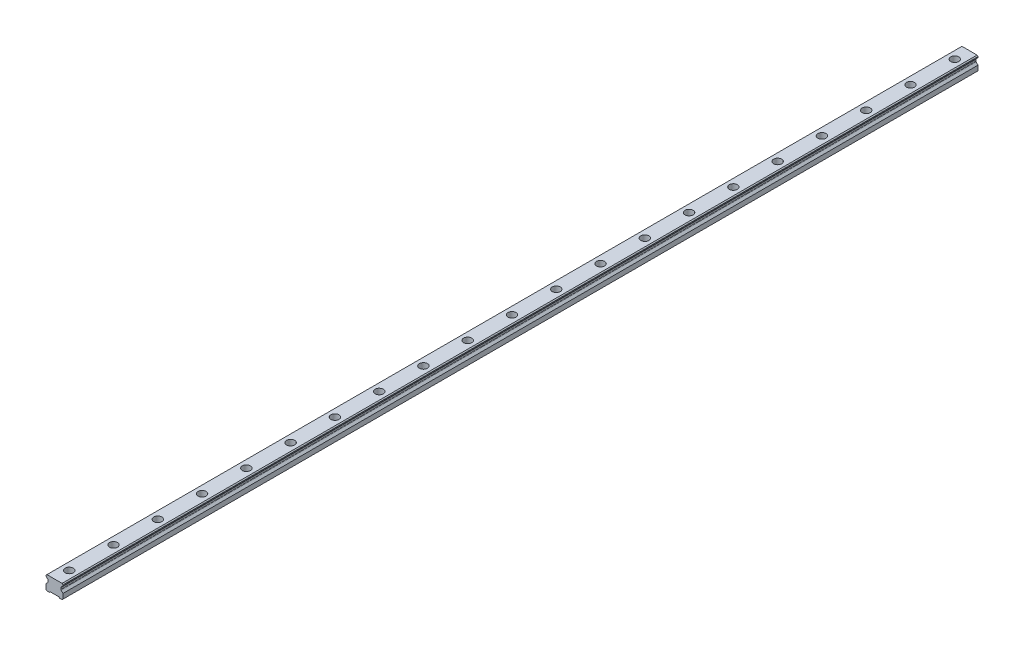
ISO-10303-21;
HEADER;
FILE_DESCRIPTION(('STEP AP214'),'2;1');
FILE_NAME('part.step','',(''),(''),'','','');
FILE_SCHEMA(('AUTOMOTIVE_DESIGN { 1 0 10303 214 1 1 1 1 }'));
ENDSEC;
DATA;
#1=APPLICATION_CONTEXT('core data for automotive mechanical design processes');
#2=APPLICATION_PROTOCOL_DEFINITION('international standard','automotive_design',2000,#1);
#3=PRODUCT_CONTEXT('',#1,'mechanical');
#4=PRODUCT('Part','Part','',(#3));
#5=PRODUCT_RELATED_PRODUCT_CATEGORY('part','',(#4));
#6=PRODUCT_DEFINITION_FORMATION('','',#4);
#7=PRODUCT_DEFINITION_CONTEXT('part definition',#1,'design');
#8=PRODUCT_DEFINITION('design','',#6,#7);
#9=PRODUCT_DEFINITION_SHAPE('','',#8);
#10=(LENGTH_UNIT() NAMED_UNIT(*) SI_UNIT(.MILLI.,.METRE.));
#11=(NAMED_UNIT(*) PLANE_ANGLE_UNIT() SI_UNIT($,.RADIAN.));
#12=(NAMED_UNIT(*) SI_UNIT($,.STERADIAN.) SOLID_ANGLE_UNIT());
#13=UNCERTAINTY_MEASURE_WITH_UNIT(LENGTH_MEASURE(1.E-05),#10,'distance_accuracy_value','');
#14=(GEOMETRIC_REPRESENTATION_CONTEXT(3) GLOBAL_UNCERTAINTY_ASSIGNED_CONTEXT((#13)) GLOBAL_UNIT_ASSIGNED_CONTEXT((#10,
#11,#12)) REPRESENTATION_CONTEXT('',''));
#15=CARTESIAN_POINT('',(0.,0.,0.));
#16=DIRECTION('',(0.,0.,1.));
#17=DIRECTION('',(1.,0.,0.));
#18=AXIS2_PLACEMENT_3D('',#15,#16,#17);
#19=CARTESIAN_POINT('',(0.,10.2,-600.));
#20=DIRECTION('',(0.,1.,0.));
#21=DIRECTION('',(0.,0.,1.));
#22=AXIS2_PLACEMENT_3D('',#19,#20,#21);
#23=PLANE('',#22);
#24=CARTESIAN_POINT('',(0.,10.2,-600.));
#25=DIRECTION('',(0.,1.,0.));
#26=DIRECTION('',(0.,0.,1.));
#27=AXIS2_PLACEMENT_3D('',#24,#25,#26);
#28=CIRCLE('',#27,3.5);
#29=CARTESIAN_POINT('',(0.,10.2,-596.5));
#30=VERTEX_POINT('',#29);
#31=EDGE_CURVE('E510',#30,#30,#28,.T.);
#32=ORIENTED_EDGE('',*,*,#31,.F.);
#33=EDGE_LOOP('',(#32));
#34=FACE_BOUND('',#33,.T.);
#35=CARTESIAN_POINT('',(0.,10.2,-600.));
#36=DIRECTION('',(0.,1.,0.));
#37=DIRECTION('',(0.,0.,1.));
#38=AXIS2_PLACEMENT_3D('',#35,#36,#37);
#39=CIRCLE('',#38,5.5);
#40=CARTESIAN_POINT('',(0.,10.2,-594.5));
#41=VERTEX_POINT('',#40);
#42=EDGE_CURVE('E11',#41,#41,#39,.T.);
#43=ORIENTED_EDGE('',*,*,#42,.T.);
#44=EDGE_LOOP('',(#43));
#45=FACE_BOUND('',#44,.T.);
#46=ADVANCED_FACE('F39',(#34,#45),#23,.T.);
#47=CARTESIAN_POINT('',(0.,10.2,-600.));
#48=DIRECTION('',(0.,1.,0.));
#49=DIRECTION('',(0.,0.,1.));
#50=AXIS2_PLACEMENT_3D('',#47,#48,#49);
#51=CYLINDRICAL_SURFACE('',#50,5.5);
#52=ORIENTED_EDGE('',*,*,#42,.F.);
#53=EDGE_LOOP('',(#52));
#54=FACE_BOUND('',#53,.T.);
#55=CARTESIAN_POINT('',(0.,19.2,-600.));
#56=DIRECTION('',(0.,1.,0.));
#57=DIRECTION('',(0.,0.,1.));
#58=AXIS2_PLACEMENT_3D('',#55,#56,#57);
#59=CIRCLE('',#58,5.5);
#60=CARTESIAN_POINT('',(0.,19.2,-594.5));
#61=VERTEX_POINT('',#60);
#62=EDGE_CURVE('E48',#61,#61,#59,.T.);
#63=ORIENTED_EDGE('',*,*,#62,.T.);
#64=EDGE_LOOP('',(#63));
#65=FACE_BOUND('',#64,.T.);
#66=ADVANCED_FACE('F871',(#54,#65),#51,.F.);
#67=CARTESIAN_POINT('',(0.,10.2,-540.));
#68=DIRECTION('',(0.,1.,0.));
#69=DIRECTION('',(0.,0.,1.));
#70=AXIS2_PLACEMENT_3D('',#67,#68,#69);
#71=PLANE('',#70);
#72=CARTESIAN_POINT('',(0.,10.2,-540.));
#73=DIRECTION('',(0.,1.,0.));
#74=DIRECTION('',(0.,0.,1.));
#75=AXIS2_PLACEMENT_3D('',#72,#73,#74);
#76=CIRCLE('',#75,3.5);
#77=CARTESIAN_POINT('',(0.,10.2,-536.5));
#78=VERTEX_POINT('',#77);
#79=EDGE_CURVE('E515',#78,#78,#76,.T.);
#80=ORIENTED_EDGE('',*,*,#79,.F.);
#81=EDGE_LOOP('',(#80));
#82=FACE_BOUND('',#81,.T.);
#83=CARTESIAN_POINT('',(0.,10.2,-540.));
#84=DIRECTION('',(0.,1.,0.));
#85=DIRECTION('',(0.,0.,1.));
#86=AXIS2_PLACEMENT_3D('',#83,#84,#85);
#87=CIRCLE('',#86,5.5);
#88=CARTESIAN_POINT('',(0.,10.2,-534.5));
#89=VERTEX_POINT('',#88);
#90=EDGE_CURVE('E494',#89,#89,#87,.T.);
#91=ORIENTED_EDGE('',*,*,#90,.T.);
#92=EDGE_LOOP('',(#91));
#93=FACE_BOUND('',#92,.T.);
#94=ADVANCED_FACE('F873',(#82,#93),#71,.T.);
#95=CARTESIAN_POINT('',(0.,10.2,-540.));
#96=DIRECTION('',(0.,1.,0.));
#97=DIRECTION('',(0.,0.,1.));
#98=AXIS2_PLACEMENT_3D('',#95,#96,#97);
#99=CYLINDRICAL_SURFACE('',#98,5.5);
#100=ORIENTED_EDGE('',*,*,#90,.F.);
#101=EDGE_LOOP('',(#100));
#102=FACE_BOUND('',#101,.T.);
#103=CARTESIAN_POINT('',(0.,19.2,-540.));
#104=DIRECTION('',(0.,1.,0.));
#105=DIRECTION('',(0.,0.,1.));
#106=AXIS2_PLACEMENT_3D('',#103,#104,#105);
#107=CIRCLE('',#106,5.5);
#108=CARTESIAN_POINT('',(0.,19.2,-534.5));
#109=VERTEX_POINT('',#108);
#110=EDGE_CURVE('E490',#109,#109,#107,.T.);
#111=ORIENTED_EDGE('',*,*,#110,.T.);
#112=EDGE_LOOP('',(#111));
#113=FACE_BOUND('',#112,.T.);
#114=ADVANCED_FACE('F879',(#102,#113),#99,.F.);
#115=CARTESIAN_POINT('',(0.,10.2,-480.));
#116=DIRECTION('',(0.,1.,0.));
#117=DIRECTION('',(0.,0.,1.));
#118=AXIS2_PLACEMENT_3D('',#115,#116,#117);
#119=PLANE('',#118);
#120=CARTESIAN_POINT('',(0.,10.2,-480.));
#121=DIRECTION('',(0.,1.,0.));
#122=DIRECTION('',(0.,0.,1.));
#123=AXIS2_PLACEMENT_3D('',#120,#121,#122);
#124=CIRCLE('',#123,3.5);
#125=CARTESIAN_POINT('',(0.,10.2,-476.5));
#126=VERTEX_POINT('',#125);
#127=EDGE_CURVE('E520',#126,#126,#124,.T.);
#128=ORIENTED_EDGE('',*,*,#127,.F.);
#129=EDGE_LOOP('',(#128));
#130=FACE_BOUND('',#129,.T.);
#131=CARTESIAN_POINT('',(0.,10.2,-480.));
#132=DIRECTION('',(0.,1.,0.));
#133=DIRECTION('',(0.,0.,1.));
#134=AXIS2_PLACEMENT_3D('',#131,#132,#133);
#135=CIRCLE('',#134,5.5);
#136=CARTESIAN_POINT('',(0.,10.2,-474.5));
#137=VERTEX_POINT('',#136);
#138=EDGE_CURVE('E486',#137,#137,#135,.T.);
#139=ORIENTED_EDGE('',*,*,#138,.T.);
#140=EDGE_LOOP('',(#139));
#141=FACE_BOUND('',#140,.T.);
#142=ADVANCED_FACE('F887',(#130,#141),#119,.T.);
#143=CARTESIAN_POINT('',(0.,10.2,-480.));
#144=DIRECTION('',(0.,1.,0.));
#145=DIRECTION('',(0.,0.,1.));
#146=AXIS2_PLACEMENT_3D('',#143,#144,#145);
#147=CYLINDRICAL_SURFACE('',#146,5.5);
#148=ORIENTED_EDGE('',*,*,#138,.F.);
#149=EDGE_LOOP('',(#148));
#150=FACE_BOUND('',#149,.T.);
#151=CARTESIAN_POINT('',(0.,19.2,-480.));
#152=DIRECTION('',(0.,1.,0.));
#153=DIRECTION('',(0.,0.,1.));
#154=AXIS2_PLACEMENT_3D('',#151,#152,#153);
#155=CIRCLE('',#154,5.5);
#156=CARTESIAN_POINT('',(0.,19.2,-474.5));
#157=VERTEX_POINT('',#156);
#158=EDGE_CURVE('E482',#157,#157,#155,.T.);
#159=ORIENTED_EDGE('',*,*,#158,.T.);
#160=EDGE_LOOP('',(#159));
#161=FACE_BOUND('',#160,.T.);
#162=ADVANCED_FACE('F891',(#150,#161),#147,.F.);
#163=CARTESIAN_POINT('',(0.,10.2,-420.));
#164=DIRECTION('',(0.,1.,0.));
#165=DIRECTION('',(0.,0.,1.));
#166=AXIS2_PLACEMENT_3D('',#163,#164,#165);
#167=PLANE('',#166);
#168=CARTESIAN_POINT('',(0.,10.2,-420.));
#169=DIRECTION('',(0.,1.,0.));
#170=DIRECTION('',(0.,0.,1.));
#171=AXIS2_PLACEMENT_3D('',#168,#169,#170);
#172=CIRCLE('',#171,3.5);
#173=CARTESIAN_POINT('',(0.,10.2,-416.5));
#174=VERTEX_POINT('',#173);
#175=EDGE_CURVE('E525',#174,#174,#172,.T.);
#176=ORIENTED_EDGE('',*,*,#175,.F.);
#177=EDGE_LOOP('',(#176));
#178=FACE_BOUND('',#177,.T.);
#179=CARTESIAN_POINT('',(0.,10.2,-420.));
#180=DIRECTION('',(0.,1.,0.));
#181=DIRECTION('',(0.,0.,1.));
#182=AXIS2_PLACEMENT_3D('',#179,#180,#181);
#183=CIRCLE('',#182,5.5);
#184=CARTESIAN_POINT('',(0.,10.2,-414.5));
#185=VERTEX_POINT('',#184);
#186=EDGE_CURVE('E478',#185,#185,#183,.T.);
#187=ORIENTED_EDGE('',*,*,#186,.T.);
#188=EDGE_LOOP('',(#187));
#189=FACE_BOUND('',#188,.T.);
#190=ADVANCED_FACE('F895',(#178,#189),#167,.T.);
#191=CARTESIAN_POINT('',(0.,10.2,-420.));
#192=DIRECTION('',(0.,1.,0.));
#193=DIRECTION('',(0.,0.,1.));
#194=AXIS2_PLACEMENT_3D('',#191,#192,#193);
#195=CYLINDRICAL_SURFACE('',#194,5.5);
#196=ORIENTED_EDGE('',*,*,#186,.F.);
#197=EDGE_LOOP('',(#196));
#198=FACE_BOUND('',#197,.T.);
#199=CARTESIAN_POINT('',(0.,19.2,-420.));
#200=DIRECTION('',(0.,1.,0.));
#201=DIRECTION('',(0.,0.,1.));
#202=AXIS2_PLACEMENT_3D('',#199,#200,#201);
#203=CIRCLE('',#202,5.5);
#204=CARTESIAN_POINT('',(0.,19.2,-414.5));
#205=VERTEX_POINT('',#204);
#206=EDGE_CURVE('E474',#205,#205,#203,.T.);
#207=ORIENTED_EDGE('',*,*,#206,.T.);
#208=EDGE_LOOP('',(#207));
#209=FACE_BOUND('',#208,.T.);
#210=ADVANCED_FACE('F899',(#198,#209),#195,.F.);
#211=CARTESIAN_POINT('',(0.,10.2,-360.));
#212=DIRECTION('',(0.,1.,0.));
#213=DIRECTION('',(0.,0.,1.));
#214=AXIS2_PLACEMENT_3D('',#211,#212,#213);
#215=PLANE('',#214);
#216=CARTESIAN_POINT('',(0.,10.2,-360.));
#217=DIRECTION('',(0.,1.,0.));
#218=DIRECTION('',(0.,0.,1.));
#219=AXIS2_PLACEMENT_3D('',#216,#217,#218);
#220=CIRCLE('',#219,3.5);
#221=CARTESIAN_POINT('',(0.,10.2,-356.5));
#222=VERTEX_POINT('',#221);
#223=EDGE_CURVE('E530',#222,#222,#220,.T.);
#224=ORIENTED_EDGE('',*,*,#223,.F.);
#225=EDGE_LOOP('',(#224));
#226=FACE_BOUND('',#225,.T.);
#227=CARTESIAN_POINT('',(0.,10.2,-360.));
#228=DIRECTION('',(0.,1.,0.));
#229=DIRECTION('',(0.,0.,1.));
#230=AXIS2_PLACEMENT_3D('',#227,#228,#229);
#231=CIRCLE('',#230,5.5);
#232=CARTESIAN_POINT('',(0.,10.2,-354.5));
#233=VERTEX_POINT('',#232);
#234=EDGE_CURVE('E470',#233,#233,#231,.T.);
#235=ORIENTED_EDGE('',*,*,#234,.T.);
#236=EDGE_LOOP('',(#235));
#237=FACE_BOUND('',#236,.T.);
#238=ADVANCED_FACE('F903',(#226,#237),#215,.T.);
#239=CARTESIAN_POINT('',(0.,10.2,-360.));
#240=DIRECTION('',(0.,1.,0.));
#241=DIRECTION('',(0.,0.,1.));
#242=AXIS2_PLACEMENT_3D('',#239,#240,#241);
#243=CYLINDRICAL_SURFACE('',#242,5.5);
#244=ORIENTED_EDGE('',*,*,#234,.F.);
#245=EDGE_LOOP('',(#244));
#246=FACE_BOUND('',#245,.T.);
#247=CARTESIAN_POINT('',(0.,19.2,-360.));
#248=DIRECTION('',(0.,1.,0.));
#249=DIRECTION('',(0.,0.,1.));
#250=AXIS2_PLACEMENT_3D('',#247,#248,#249);
#251=CIRCLE('',#250,5.5);
#252=CARTESIAN_POINT('',(0.,19.2,-354.5));
#253=VERTEX_POINT('',#252);
#254=EDGE_CURVE('E466',#253,#253,#251,.T.);
#255=ORIENTED_EDGE('',*,*,#254,.T.);
#256=EDGE_LOOP('',(#255));
#257=FACE_BOUND('',#256,.T.);
#258=ADVANCED_FACE('F907',(#246,#257),#243,.F.);
#259=CARTESIAN_POINT('',(0.,10.2,-300.));
#260=DIRECTION('',(0.,1.,0.));
#261=DIRECTION('',(0.,0.,1.));
#262=AXIS2_PLACEMENT_3D('',#259,#260,#261);
#263=PLANE('',#262);
#264=CARTESIAN_POINT('',(0.,10.2,-300.));
#265=DIRECTION('',(0.,1.,0.));
#266=DIRECTION('',(0.,0.,1.));
#267=AXIS2_PLACEMENT_3D('',#264,#265,#266);
#268=CIRCLE('',#267,3.5);
#269=CARTESIAN_POINT('',(0.,10.2,-296.5));
#270=VERTEX_POINT('',#269);
#271=EDGE_CURVE('E535',#270,#270,#268,.T.);
#272=ORIENTED_EDGE('',*,*,#271,.F.);
#273=EDGE_LOOP('',(#272));
#274=FACE_BOUND('',#273,.T.);
#275=CARTESIAN_POINT('',(0.,10.2,-300.));
#276=DIRECTION('',(0.,1.,0.));
#277=DIRECTION('',(0.,0.,1.));
#278=AXIS2_PLACEMENT_3D('',#275,#276,#277);
#279=CIRCLE('',#278,5.5);
#280=CARTESIAN_POINT('',(0.,10.2,-294.5));
#281=VERTEX_POINT('',#280);
#282=EDGE_CURVE('E462',#281,#281,#279,.T.);
#283=ORIENTED_EDGE('',*,*,#282,.T.);
#284=EDGE_LOOP('',(#283));
#285=FACE_BOUND('',#284,.T.);
#286=ADVANCED_FACE('F911',(#274,#285),#263,.T.);
#287=CARTESIAN_POINT('',(0.,10.2,-300.));
#288=DIRECTION('',(0.,1.,0.));
#289=DIRECTION('',(0.,0.,1.));
#290=AXIS2_PLACEMENT_3D('',#287,#288,#289);
#291=CYLINDRICAL_SURFACE('',#290,5.5);
#292=ORIENTED_EDGE('',*,*,#282,.F.);
#293=EDGE_LOOP('',(#292));
#294=FACE_BOUND('',#293,.T.);
#295=CARTESIAN_POINT('',(0.,19.2,-300.));
#296=DIRECTION('',(0.,1.,0.));
#297=DIRECTION('',(0.,0.,1.));
#298=AXIS2_PLACEMENT_3D('',#295,#296,#297);
#299=CIRCLE('',#298,5.5);
#300=CARTESIAN_POINT('',(0.,19.2,-294.5));
#301=VERTEX_POINT('',#300);
#302=EDGE_CURVE('E458',#301,#301,#299,.T.);
#303=ORIENTED_EDGE('',*,*,#302,.T.);
#304=EDGE_LOOP('',(#303));
#305=FACE_BOUND('',#304,.T.);
#306=ADVANCED_FACE('F915',(#294,#305),#291,.F.);
#307=CARTESIAN_POINT('',(0.,10.2,-240.));
#308=DIRECTION('',(0.,1.,0.));
#309=DIRECTION('',(0.,0.,1.));
#310=AXIS2_PLACEMENT_3D('',#307,#308,#309);
#311=PLANE('',#310);
#312=CARTESIAN_POINT('',(0.,10.2,-240.));
#313=DIRECTION('',(0.,1.,0.));
#314=DIRECTION('',(0.,0.,1.));
#315=AXIS2_PLACEMENT_3D('',#312,#313,#314);
#316=CIRCLE('',#315,3.5);
#317=CARTESIAN_POINT('',(0.,10.2,-236.5));
#318=VERTEX_POINT('',#317);
#319=EDGE_CURVE('E540',#318,#318,#316,.T.);
#320=ORIENTED_EDGE('',*,*,#319,.F.);
#321=EDGE_LOOP('',(#320));
#322=FACE_BOUND('',#321,.T.);
#323=CARTESIAN_POINT('',(0.,10.2,-240.));
#324=DIRECTION('',(0.,1.,0.));
#325=DIRECTION('',(0.,0.,1.));
#326=AXIS2_PLACEMENT_3D('',#323,#324,#325);
#327=CIRCLE('',#326,5.5);
#328=CARTESIAN_POINT('',(0.,10.2,-234.5));
#329=VERTEX_POINT('',#328);
#330=EDGE_CURVE('E454',#329,#329,#327,.T.);
#331=ORIENTED_EDGE('',*,*,#330,.T.);
#332=EDGE_LOOP('',(#331));
#333=FACE_BOUND('',#332,.T.);
#334=ADVANCED_FACE('F919',(#322,#333),#311,.T.);
#335=CARTESIAN_POINT('',(0.,10.2,-240.));
#336=DIRECTION('',(0.,1.,0.));
#337=DIRECTION('',(0.,0.,1.));
#338=AXIS2_PLACEMENT_3D('',#335,#336,#337);
#339=CYLINDRICAL_SURFACE('',#338,5.5);
#340=ORIENTED_EDGE('',*,*,#330,.F.);
#341=EDGE_LOOP('',(#340));
#342=FACE_BOUND('',#341,.T.);
#343=CARTESIAN_POINT('',(0.,19.2,-240.));
#344=DIRECTION('',(0.,1.,0.));
#345=DIRECTION('',(0.,0.,1.));
#346=AXIS2_PLACEMENT_3D('',#343,#344,#345);
#347=CIRCLE('',#346,5.5);
#348=CARTESIAN_POINT('',(0.,19.2,-234.5));
#349=VERTEX_POINT('',#348);
#350=EDGE_CURVE('E450',#349,#349,#347,.T.);
#351=ORIENTED_EDGE('',*,*,#350,.T.);
#352=EDGE_LOOP('',(#351));
#353=FACE_BOUND('',#352,.T.);
#354=ADVANCED_FACE('F923',(#342,#353),#339,.F.);
#355=CARTESIAN_POINT('',(0.,10.2,-180.));
#356=DIRECTION('',(0.,1.,0.));
#357=DIRECTION('',(0.,0.,1.));
#358=AXIS2_PLACEMENT_3D('',#355,#356,#357);
#359=PLANE('',#358);
#360=CARTESIAN_POINT('',(0.,10.2,-180.));
#361=DIRECTION('',(0.,1.,0.));
#362=DIRECTION('',(0.,0.,1.));
#363=AXIS2_PLACEMENT_3D('',#360,#361,#362);
#364=CIRCLE('',#363,3.5);
#365=CARTESIAN_POINT('',(0.,10.2,-176.5));
#366=VERTEX_POINT('',#365);
#367=EDGE_CURVE('E545',#366,#366,#364,.T.);
#368=ORIENTED_EDGE('',*,*,#367,.F.);
#369=EDGE_LOOP('',(#368));
#370=FACE_BOUND('',#369,.T.);
#371=CARTESIAN_POINT('',(0.,10.2,-180.));
#372=DIRECTION('',(0.,1.,0.));
#373=DIRECTION('',(0.,0.,1.));
#374=AXIS2_PLACEMENT_3D('',#371,#372,#373);
#375=CIRCLE('',#374,5.5);
#376=CARTESIAN_POINT('',(0.,10.2,-174.5));
#377=VERTEX_POINT('',#376);
#378=EDGE_CURVE('E446',#377,#377,#375,.T.);
#379=ORIENTED_EDGE('',*,*,#378,.T.);
#380=EDGE_LOOP('',(#379));
#381=FACE_BOUND('',#380,.T.);
#382=ADVANCED_FACE('F927',(#370,#381),#359,.T.);
#383=CARTESIAN_POINT('',(0.,10.2,-180.));
#384=DIRECTION('',(0.,1.,0.));
#385=DIRECTION('',(0.,0.,1.));
#386=AXIS2_PLACEMENT_3D('',#383,#384,#385);
#387=CYLINDRICAL_SURFACE('',#386,5.5);
#388=ORIENTED_EDGE('',*,*,#378,.F.);
#389=EDGE_LOOP('',(#388));
#390=FACE_BOUND('',#389,.T.);
#391=CARTESIAN_POINT('',(0.,19.2,-180.));
#392=DIRECTION('',(0.,1.,0.));
#393=DIRECTION('',(0.,0.,1.));
#394=AXIS2_PLACEMENT_3D('',#391,#392,#393);
#395=CIRCLE('',#394,5.5);
#396=CARTESIAN_POINT('',(0.,19.2,-174.5));
#397=VERTEX_POINT('',#396);
#398=EDGE_CURVE('E442',#397,#397,#395,.T.);
#399=ORIENTED_EDGE('',*,*,#398,.T.);
#400=EDGE_LOOP('',(#399));
#401=FACE_BOUND('',#400,.T.);
#402=ADVANCED_FACE('F931',(#390,#401),#387,.F.);
#403=CARTESIAN_POINT('',(0.,10.2,-120.));
#404=DIRECTION('',(0.,1.,0.));
#405=DIRECTION('',(0.,0.,1.));
#406=AXIS2_PLACEMENT_3D('',#403,#404,#405);
#407=PLANE('',#406);
#408=CARTESIAN_POINT('',(0.,10.2,-120.));
#409=DIRECTION('',(0.,1.,0.));
#410=DIRECTION('',(0.,0.,1.));
#411=AXIS2_PLACEMENT_3D('',#408,#409,#410);
#412=CIRCLE('',#411,3.5);
#413=CARTESIAN_POINT('',(0.,10.2,-116.5));
#414=VERTEX_POINT('',#413);
#415=EDGE_CURVE('E550',#414,#414,#412,.T.);
#416=ORIENTED_EDGE('',*,*,#415,.F.);
#417=EDGE_LOOP('',(#416));
#418=FACE_BOUND('',#417,.T.);
#419=CARTESIAN_POINT('',(0.,10.2,-120.));
#420=DIRECTION('',(0.,1.,0.));
#421=DIRECTION('',(0.,0.,1.));
#422=AXIS2_PLACEMENT_3D('',#419,#420,#421);
#423=CIRCLE('',#422,5.5);
#424=CARTESIAN_POINT('',(0.,10.2,-114.5));
#425=VERTEX_POINT('',#424);
#426=EDGE_CURVE('E438',#425,#425,#423,.T.);
#427=ORIENTED_EDGE('',*,*,#426,.T.);
#428=EDGE_LOOP('',(#427));
#429=FACE_BOUND('',#428,.T.);
#430=ADVANCED_FACE('F935',(#418,#429),#407,.T.);
#431=CARTESIAN_POINT('',(0.,10.2,-120.));
#432=DIRECTION('',(0.,1.,0.));
#433=DIRECTION('',(0.,0.,1.));
#434=AXIS2_PLACEMENT_3D('',#431,#432,#433);
#435=CYLINDRICAL_SURFACE('',#434,5.5);
#436=ORIENTED_EDGE('',*,*,#426,.F.);
#437=EDGE_LOOP('',(#436));
#438=FACE_BOUND('',#437,.T.);
#439=CARTESIAN_POINT('',(0.,19.2,-120.));
#440=DIRECTION('',(0.,1.,0.));
#441=DIRECTION('',(0.,0.,1.));
#442=AXIS2_PLACEMENT_3D('',#439,#440,#441);
#443=CIRCLE('',#442,5.5);
#444=CARTESIAN_POINT('',(0.,19.2,-114.5));
#445=VERTEX_POINT('',#444);
#446=EDGE_CURVE('E434',#445,#445,#443,.T.);
#447=ORIENTED_EDGE('',*,*,#446,.T.);
#448=EDGE_LOOP('',(#447));
#449=FACE_BOUND('',#448,.T.);
#450=ADVANCED_FACE('F939',(#438,#449),#435,.F.);
#451=CARTESIAN_POINT('',(0.,10.2,-59.9999999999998));
#452=DIRECTION('',(0.,1.,0.));
#453=DIRECTION('',(0.,0.,1.));
#454=AXIS2_PLACEMENT_3D('',#451,#452,#453);
#455=PLANE('',#454);
#456=CARTESIAN_POINT('',(0.,10.2,-59.9999999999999));
#457=DIRECTION('',(0.,1.,0.));
#458=DIRECTION('',(0.,0.,1.));
#459=AXIS2_PLACEMENT_3D('',#456,#457,#458);
#460=CIRCLE('',#459,3.5);
#461=CARTESIAN_POINT('',(0.,10.2,-56.4999999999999));
#462=VERTEX_POINT('',#461);
#463=EDGE_CURVE('E555',#462,#462,#460,.T.);
#464=ORIENTED_EDGE('',*,*,#463,.F.);
#465=EDGE_LOOP('',(#464));
#466=FACE_BOUND('',#465,.T.);
#467=CARTESIAN_POINT('',(0.,10.2,-59.9999999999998));
#468=DIRECTION('',(0.,1.,0.));
#469=DIRECTION('',(0.,0.,1.));
#470=AXIS2_PLACEMENT_3D('',#467,#468,#469);
#471=CIRCLE('',#470,5.5);
#472=CARTESIAN_POINT('',(0.,10.2,-54.4999999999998));
#473=VERTEX_POINT('',#472);
#474=EDGE_CURVE('E430',#473,#473,#471,.T.);
#475=ORIENTED_EDGE('',*,*,#474,.T.);
#476=EDGE_LOOP('',(#475));
#477=FACE_BOUND('',#476,.T.);
#478=ADVANCED_FACE('F943',(#466,#477),#455,.T.);
#479=CARTESIAN_POINT('',(0.,10.2,-59.9999999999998));
#480=DIRECTION('',(0.,1.,0.));
#481=DIRECTION('',(0.,0.,1.));
#482=AXIS2_PLACEMENT_3D('',#479,#480,#481);
#483=CYLINDRICAL_SURFACE('',#482,5.5);
#484=ORIENTED_EDGE('',*,*,#474,.F.);
#485=EDGE_LOOP('',(#484));
#486=FACE_BOUND('',#485,.T.);
#487=CARTESIAN_POINT('',(0.,19.2,-59.9999999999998));
#488=DIRECTION('',(0.,1.,0.));
#489=DIRECTION('',(0.,0.,1.));
#490=AXIS2_PLACEMENT_3D('',#487,#488,#489);
#491=CIRCLE('',#490,5.5);
#492=CARTESIAN_POINT('',(0.,19.2,-54.4999999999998));
#493=VERTEX_POINT('',#492);
#494=EDGE_CURVE('E426',#493,#493,#491,.T.);
#495=ORIENTED_EDGE('',*,*,#494,.T.);
#496=EDGE_LOOP('',(#495));
#497=FACE_BOUND('',#496,.T.);
#498=ADVANCED_FACE('F947',(#486,#497),#483,.F.);
#499=CARTESIAN_POINT('',(0.,10.2,0.));
#500=DIRECTION('',(0.,1.,0.));
#501=DIRECTION('',(0.,0.,1.));
#502=AXIS2_PLACEMENT_3D('',#499,#500,#501);
#503=PLANE('',#502);
#504=CARTESIAN_POINT('',(0.,10.2,0.));
#505=DIRECTION('',(0.,1.,0.));
#506=DIRECTION('',(0.,0.,1.));
#507=AXIS2_PLACEMENT_3D('',#504,#505,#506);
#508=CIRCLE('',#507,3.5);
#509=CARTESIAN_POINT('',(0.,10.2,3.5));
#510=VERTEX_POINT('',#509);
#511=EDGE_CURVE('E560',#510,#510,#508,.T.);
#512=ORIENTED_EDGE('',*,*,#511,.F.);
#513=EDGE_LOOP('',(#512));
#514=FACE_BOUND('',#513,.T.);
#515=CARTESIAN_POINT('',(0.,10.2,0.));
#516=DIRECTION('',(0.,1.,0.));
#517=DIRECTION('',(0.,0.,1.));
#518=AXIS2_PLACEMENT_3D('',#515,#516,#517);
#519=CIRCLE('',#518,5.5);
#520=CARTESIAN_POINT('',(0.,10.2,5.5));
#521=VERTEX_POINT('',#520);
#522=EDGE_CURVE('E422',#521,#521,#519,.T.);
#523=ORIENTED_EDGE('',*,*,#522,.T.);
#524=EDGE_LOOP('',(#523));
#525=FACE_BOUND('',#524,.T.);
#526=ADVANCED_FACE('F951',(#514,#525),#503,.T.);
#527=CARTESIAN_POINT('',(0.,10.2,0.));
#528=DIRECTION('',(0.,1.,0.));
#529=DIRECTION('',(0.,0.,1.));
#530=AXIS2_PLACEMENT_3D('',#527,#528,#529);
#531=CYLINDRICAL_SURFACE('',#530,5.5);
#532=ORIENTED_EDGE('',*,*,#522,.F.);
#533=EDGE_LOOP('',(#532));
#534=FACE_BOUND('',#533,.T.);
#535=CARTESIAN_POINT('',(0.,19.2,0.));
#536=DIRECTION('',(0.,1.,0.));
#537=DIRECTION('',(0.,0.,1.));
#538=AXIS2_PLACEMENT_3D('',#535,#536,#537);
#539=CIRCLE('',#538,5.5);
#540=CARTESIAN_POINT('',(0.,19.2,5.5));
#541=VERTEX_POINT('',#540);
#542=EDGE_CURVE('E418',#541,#541,#539,.T.);
#543=ORIENTED_EDGE('',*,*,#542,.T.);
#544=EDGE_LOOP('',(#543));
#545=FACE_BOUND('',#544,.T.);
#546=ADVANCED_FACE('F955',(#534,#545),#531,.F.);
#547=CARTESIAN_POINT('',(0.,10.2,60.));
#548=DIRECTION('',(0.,1.,0.));
#549=DIRECTION('',(0.,0.,1.));
#550=AXIS2_PLACEMENT_3D('',#547,#548,#549);
#551=PLANE('',#550);
#552=CARTESIAN_POINT('',(0.,10.2,59.9999999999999));
#553=DIRECTION('',(0.,1.,0.));
#554=DIRECTION('',(0.,0.,1.));
#555=AXIS2_PLACEMENT_3D('',#552,#553,#554);
#556=CIRCLE('',#555,3.5);
#557=CARTESIAN_POINT('',(0.,10.2,63.4999999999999));
#558=VERTEX_POINT('',#557);
#559=EDGE_CURVE('E565',#558,#558,#556,.T.);
#560=ORIENTED_EDGE('',*,*,#559,.F.);
#561=EDGE_LOOP('',(#560));
#562=FACE_BOUND('',#561,.T.);
#563=CARTESIAN_POINT('',(0.,10.2,60.));
#564=DIRECTION('',(0.,1.,0.));
#565=DIRECTION('',(0.,0.,1.));
#566=AXIS2_PLACEMENT_3D('',#563,#564,#565);
#567=CIRCLE('',#566,5.5);
#568=CARTESIAN_POINT('',(0.,10.2,65.5));
#569=VERTEX_POINT('',#568);
#570=EDGE_CURVE('E414',#569,#569,#567,.T.);
#571=ORIENTED_EDGE('',*,*,#570,.T.);
#572=EDGE_LOOP('',(#571));
#573=FACE_BOUND('',#572,.T.);
#574=ADVANCED_FACE('F959',(#562,#573),#551,.T.);
#575=CARTESIAN_POINT('',(0.,10.2,60.));
#576=DIRECTION('',(0.,1.,0.));
#577=DIRECTION('',(0.,0.,1.));
#578=AXIS2_PLACEMENT_3D('',#575,#576,#577);
#579=CYLINDRICAL_SURFACE('',#578,5.5);
#580=ORIENTED_EDGE('',*,*,#570,.F.);
#581=EDGE_LOOP('',(#580));
#582=FACE_BOUND('',#581,.T.);
#583=CARTESIAN_POINT('',(0.,19.2,60.));
#584=DIRECTION('',(0.,1.,0.));
#585=DIRECTION('',(0.,0.,1.));
#586=AXIS2_PLACEMENT_3D('',#583,#584,#585);
#587=CIRCLE('',#586,5.5);
#588=CARTESIAN_POINT('',(0.,19.2,65.5));
#589=VERTEX_POINT('',#588);
#590=EDGE_CURVE('E410',#589,#589,#587,.T.);
#591=ORIENTED_EDGE('',*,*,#590,.T.);
#592=EDGE_LOOP('',(#591));
#593=FACE_BOUND('',#592,.T.);
#594=ADVANCED_FACE('F963',(#582,#593),#579,.F.);
#595=CARTESIAN_POINT('',(0.,10.2,120.));
#596=DIRECTION('',(0.,1.,0.));
#597=DIRECTION('',(0.,0.,1.));
#598=AXIS2_PLACEMENT_3D('',#595,#596,#597);
#599=PLANE('',#598);
#600=CARTESIAN_POINT('',(0.,10.2,120.));
#601=DIRECTION('',(0.,1.,0.));
#602=DIRECTION('',(0.,0.,1.));
#603=AXIS2_PLACEMENT_3D('',#600,#601,#602);
#604=CIRCLE('',#603,3.5);
#605=CARTESIAN_POINT('',(0.,10.2,123.5));
#606=VERTEX_POINT('',#605);
#607=EDGE_CURVE('E570',#606,#606,#604,.T.);
#608=ORIENTED_EDGE('',*,*,#607,.F.);
#609=EDGE_LOOP('',(#608));
#610=FACE_BOUND('',#609,.T.);
#611=CARTESIAN_POINT('',(0.,10.2,120.));
#612=DIRECTION('',(0.,1.,0.));
#613=DIRECTION('',(0.,0.,1.));
#614=AXIS2_PLACEMENT_3D('',#611,#612,#613);
#615=CIRCLE('',#614,5.5);
#616=CARTESIAN_POINT('',(0.,10.2,125.5));
#617=VERTEX_POINT('',#616);
#618=EDGE_CURVE('E406',#617,#617,#615,.T.);
#619=ORIENTED_EDGE('',*,*,#618,.T.);
#620=EDGE_LOOP('',(#619));
#621=FACE_BOUND('',#620,.T.);
#622=ADVANCED_FACE('F967',(#610,#621),#599,.T.);
#623=CARTESIAN_POINT('',(0.,10.2,120.));
#624=DIRECTION('',(0.,1.,0.));
#625=DIRECTION('',(0.,0.,1.));
#626=AXIS2_PLACEMENT_3D('',#623,#624,#625);
#627=CYLINDRICAL_SURFACE('',#626,5.5);
#628=ORIENTED_EDGE('',*,*,#618,.F.);
#629=EDGE_LOOP('',(#628));
#630=FACE_BOUND('',#629,.T.);
#631=CARTESIAN_POINT('',(0.,19.2,120.));
#632=DIRECTION('',(0.,1.,0.));
#633=DIRECTION('',(0.,0.,1.));
#634=AXIS2_PLACEMENT_3D('',#631,#632,#633);
#635=CIRCLE('',#634,5.5);
#636=CARTESIAN_POINT('',(0.,19.2,125.5));
#637=VERTEX_POINT('',#636);
#638=EDGE_CURVE('E402',#637,#637,#635,.T.);
#639=ORIENTED_EDGE('',*,*,#638,.T.);
#640=EDGE_LOOP('',(#639));
#641=FACE_BOUND('',#640,.T.);
#642=ADVANCED_FACE('F971',(#630,#641),#627,.F.);
#643=CARTESIAN_POINT('',(0.,10.2,180.));
#644=DIRECTION('',(0.,1.,0.));
#645=DIRECTION('',(0.,0.,1.));
#646=AXIS2_PLACEMENT_3D('',#643,#644,#645);
#647=PLANE('',#646);
#648=CARTESIAN_POINT('',(0.,10.2,180.));
#649=DIRECTION('',(0.,1.,0.));
#650=DIRECTION('',(0.,0.,1.));
#651=AXIS2_PLACEMENT_3D('',#648,#649,#650);
#652=CIRCLE('',#651,3.5);
#653=CARTESIAN_POINT('',(0.,10.2,183.5));
#654=VERTEX_POINT('',#653);
#655=EDGE_CURVE('E575',#654,#654,#652,.T.);
#656=ORIENTED_EDGE('',*,*,#655,.F.);
#657=EDGE_LOOP('',(#656));
#658=FACE_BOUND('',#657,.T.);
#659=CARTESIAN_POINT('',(0.,10.2,180.));
#660=DIRECTION('',(0.,1.,0.));
#661=DIRECTION('',(0.,0.,1.));
#662=AXIS2_PLACEMENT_3D('',#659,#660,#661);
#663=CIRCLE('',#662,5.5);
#664=CARTESIAN_POINT('',(0.,10.2,185.5));
#665=VERTEX_POINT('',#664);
#666=EDGE_CURVE('E398',#665,#665,#663,.T.);
#667=ORIENTED_EDGE('',*,*,#666,.T.);
#668=EDGE_LOOP('',(#667));
#669=FACE_BOUND('',#668,.T.);
#670=ADVANCED_FACE('F975',(#658,#669),#647,.T.);
#671=CARTESIAN_POINT('',(0.,10.2,180.));
#672=DIRECTION('',(0.,1.,0.));
#673=DIRECTION('',(0.,0.,1.));
#674=AXIS2_PLACEMENT_3D('',#671,#672,#673);
#675=CYLINDRICAL_SURFACE('',#674,5.5);
#676=ORIENTED_EDGE('',*,*,#666,.F.);
#677=EDGE_LOOP('',(#676));
#678=FACE_BOUND('',#677,.T.);
#679=CARTESIAN_POINT('',(0.,19.2,180.));
#680=DIRECTION('',(0.,1.,0.));
#681=DIRECTION('',(0.,0.,1.));
#682=AXIS2_PLACEMENT_3D('',#679,#680,#681);
#683=CIRCLE('',#682,5.5);
#684=CARTESIAN_POINT('',(0.,19.2,185.5));
#685=VERTEX_POINT('',#684);
#686=EDGE_CURVE('E394',#685,#685,#683,.T.);
#687=ORIENTED_EDGE('',*,*,#686,.T.);
#688=EDGE_LOOP('',(#687));
#689=FACE_BOUND('',#688,.T.);
#690=ADVANCED_FACE('F827',(#678,#689),#675,.F.);
#691=CARTESIAN_POINT('',(0.,10.2,240.));
#692=DIRECTION('',(0.,1.,0.));
#693=DIRECTION('',(0.,0.,1.));
#694=AXIS2_PLACEMENT_3D('',#691,#692,#693);
#695=PLANE('',#694);
#696=CARTESIAN_POINT('',(0.,10.2,240.));
#697=DIRECTION('',(0.,1.,0.));
#698=DIRECTION('',(0.,0.,1.));
#699=AXIS2_PLACEMENT_3D('',#696,#697,#698);
#700=CIRCLE('',#699,3.5);
#701=CARTESIAN_POINT('',(0.,10.2,243.5));
#702=VERTEX_POINT('',#701);
#703=EDGE_CURVE('E580',#702,#702,#700,.T.);
#704=ORIENTED_EDGE('',*,*,#703,.F.);
#705=EDGE_LOOP('',(#704));
#706=FACE_BOUND('',#705,.T.);
#707=CARTESIAN_POINT('',(0.,10.2,240.));
#708=DIRECTION('',(0.,1.,0.));
#709=DIRECTION('',(0.,0.,1.));
#710=AXIS2_PLACEMENT_3D('',#707,#708,#709);
#711=CIRCLE('',#710,5.5);
#712=CARTESIAN_POINT('',(0.,10.2,245.5));
#713=VERTEX_POINT('',#712);
#714=EDGE_CURVE('E390',#713,#713,#711,.T.);
#715=ORIENTED_EDGE('',*,*,#714,.T.);
#716=EDGE_LOOP('',(#715));
#717=FACE_BOUND('',#716,.T.);
#718=ADVANCED_FACE('F823',(#706,#717),#695,.T.);
#719=CARTESIAN_POINT('',(0.,10.2,240.));
#720=DIRECTION('',(0.,1.,0.));
#721=DIRECTION('',(0.,0.,1.));
#722=AXIS2_PLACEMENT_3D('',#719,#720,#721);
#723=CYLINDRICAL_SURFACE('',#722,5.5);
#724=ORIENTED_EDGE('',*,*,#714,.F.);
#725=EDGE_LOOP('',(#724));
#726=FACE_BOUND('',#725,.T.);
#727=CARTESIAN_POINT('',(0.,19.2,240.));
#728=DIRECTION('',(0.,1.,0.));
#729=DIRECTION('',(0.,0.,1.));
#730=AXIS2_PLACEMENT_3D('',#727,#728,#729);
#731=CIRCLE('',#730,5.5);
#732=CARTESIAN_POINT('',(0.,19.2,245.5));
#733=VERTEX_POINT('',#732);
#734=EDGE_CURVE('E386',#733,#733,#731,.T.);
#735=ORIENTED_EDGE('',*,*,#734,.T.);
#736=EDGE_LOOP('',(#735));
#737=FACE_BOUND('',#736,.T.);
#738=ADVANCED_FACE('F826',(#726,#737),#723,.F.);
#739=CARTESIAN_POINT('',(0.,10.2,300.));
#740=DIRECTION('',(0.,1.,0.));
#741=DIRECTION('',(0.,0.,1.));
#742=AXIS2_PLACEMENT_3D('',#739,#740,#741);
#743=PLANE('',#742);
#744=CARTESIAN_POINT('',(0.,10.2,300.));
#745=DIRECTION('',(0.,1.,0.));
#746=DIRECTION('',(0.,0.,1.));
#747=AXIS2_PLACEMENT_3D('',#744,#745,#746);
#748=CIRCLE('',#747,3.5);
#749=CARTESIAN_POINT('',(0.,10.2,303.5));
#750=VERTEX_POINT('',#749);
#751=EDGE_CURVE('E585',#750,#750,#748,.T.);
#752=ORIENTED_EDGE('',*,*,#751,.F.);
#753=EDGE_LOOP('',(#752));
#754=FACE_BOUND('',#753,.T.);
#755=CARTESIAN_POINT('',(0.,10.2,300.));
#756=DIRECTION('',(0.,1.,0.));
#757=DIRECTION('',(0.,0.,1.));
#758=AXIS2_PLACEMENT_3D('',#755,#756,#757);
#759=CIRCLE('',#758,5.5);
#760=CARTESIAN_POINT('',(0.,10.2,305.5));
#761=VERTEX_POINT('',#760);
#762=EDGE_CURVE('E382',#761,#761,#759,.T.);
#763=ORIENTED_EDGE('',*,*,#762,.T.);
#764=EDGE_LOOP('',(#763));
#765=FACE_BOUND('',#764,.T.);
#766=ADVANCED_FACE('F833',(#754,#765),#743,.T.);
#767=CARTESIAN_POINT('',(0.,10.2,300.));
#768=DIRECTION('',(0.,1.,0.));
#769=DIRECTION('',(0.,0.,1.));
#770=AXIS2_PLACEMENT_3D('',#767,#768,#769);
#771=CYLINDRICAL_SURFACE('',#770,5.5);
#772=ORIENTED_EDGE('',*,*,#762,.F.);
#773=EDGE_LOOP('',(#772));
#774=FACE_BOUND('',#773,.T.);
#775=CARTESIAN_POINT('',(0.,19.2,300.));
#776=DIRECTION('',(0.,1.,0.));
#777=DIRECTION('',(0.,0.,1.));
#778=AXIS2_PLACEMENT_3D('',#775,#776,#777);
#779=CIRCLE('',#778,5.5);
#780=CARTESIAN_POINT('',(0.,19.2,305.5));
#781=VERTEX_POINT('',#780);
#782=EDGE_CURVE('E378',#781,#781,#779,.T.);
#783=ORIENTED_EDGE('',*,*,#782,.T.);
#784=EDGE_LOOP('',(#783));
#785=FACE_BOUND('',#784,.T.);
#786=ADVANCED_FACE('F985',(#774,#785),#771,.F.);
#787=CARTESIAN_POINT('',(0.,10.2,360.));
#788=DIRECTION('',(0.,1.,0.));
#789=DIRECTION('',(0.,0.,1.));
#790=AXIS2_PLACEMENT_3D('',#787,#788,#789);
#791=PLANE('',#790);
#792=CARTESIAN_POINT('',(0.,10.2,360.));
#793=DIRECTION('',(0.,1.,0.));
#794=DIRECTION('',(0.,0.,1.));
#795=AXIS2_PLACEMENT_3D('',#792,#793,#794);
#796=CIRCLE('',#795,3.5);
#797=CARTESIAN_POINT('',(0.,10.2,363.5));
#798=VERTEX_POINT('',#797);
#799=EDGE_CURVE('E589',#798,#798,#796,.T.);
#800=ORIENTED_EDGE('',*,*,#799,.F.);
#801=EDGE_LOOP('',(#800));
#802=FACE_BOUND('',#801,.T.);
#803=CARTESIAN_POINT('',(0.,10.2,360.));
#804=DIRECTION('',(0.,1.,0.));
#805=DIRECTION('',(0.,0.,1.));
#806=AXIS2_PLACEMENT_3D('',#803,#804,#805);
#807=CIRCLE('',#806,5.5);
#808=CARTESIAN_POINT('',(0.,10.2,365.5));
#809=VERTEX_POINT('',#808);
#810=EDGE_CURVE('E374',#809,#809,#807,.T.);
#811=ORIENTED_EDGE('',*,*,#810,.T.);
#812=EDGE_LOOP('',(#811));
#813=FACE_BOUND('',#812,.T.);
#814=ADVANCED_FACE('F989',(#802,#813),#791,.T.);
#815=CARTESIAN_POINT('',(0.,10.2,360.));
#816=DIRECTION('',(0.,1.,0.));
#817=DIRECTION('',(0.,0.,1.));
#818=AXIS2_PLACEMENT_3D('',#815,#816,#817);
#819=CYLINDRICAL_SURFACE('',#818,5.5);
#820=ORIENTED_EDGE('',*,*,#810,.F.);
#821=EDGE_LOOP('',(#820));
#822=FACE_BOUND('',#821,.T.);
#823=CARTESIAN_POINT('',(0.,19.2,360.));
#824=DIRECTION('',(0.,1.,0.));
#825=DIRECTION('',(0.,0.,1.));
#826=AXIS2_PLACEMENT_3D('',#823,#824,#825);
#827=CIRCLE('',#826,5.5);
#828=CARTESIAN_POINT('',(0.,19.2,365.5));
#829=VERTEX_POINT('',#828);
#830=EDGE_CURVE('E370',#829,#829,#827,.T.);
#831=ORIENTED_EDGE('',*,*,#830,.T.);
#832=EDGE_LOOP('',(#831));
#833=FACE_BOUND('',#832,.T.);
#834=ADVANCED_FACE('F993',(#822,#833),#819,.F.);
#835=CARTESIAN_POINT('',(0.,10.2,420.));
#836=DIRECTION('',(0.,1.,0.));
#837=DIRECTION('',(0.,0.,1.));
#838=AXIS2_PLACEMENT_3D('',#835,#836,#837);
#839=PLANE('',#838);
#840=CARTESIAN_POINT('',(0.,10.2,420.));
#841=DIRECTION('',(0.,1.,0.));
#842=DIRECTION('',(0.,0.,1.));
#843=AXIS2_PLACEMENT_3D('',#840,#841,#842);
#844=CIRCLE('',#843,3.5);
#845=CARTESIAN_POINT('',(0.,10.2,423.5));
#846=VERTEX_POINT('',#845);
#847=EDGE_CURVE('E593',#846,#846,#844,.T.);
#848=ORIENTED_EDGE('',*,*,#847,.F.);
#849=EDGE_LOOP('',(#848));
#850=FACE_BOUND('',#849,.T.);
#851=CARTESIAN_POINT('',(0.,10.2,420.));
#852=DIRECTION('',(0.,1.,0.));
#853=DIRECTION('',(0.,0.,1.));
#854=AXIS2_PLACEMENT_3D('',#851,#852,#853);
#855=CIRCLE('',#854,5.5);
#856=CARTESIAN_POINT('',(0.,10.2,425.5));
#857=VERTEX_POINT('',#856);
#858=EDGE_CURVE('E366',#857,#857,#855,.T.);
#859=ORIENTED_EDGE('',*,*,#858,.T.);
#860=EDGE_LOOP('',(#859));
#861=FACE_BOUND('',#860,.T.);
#862=ADVANCED_FACE('F997',(#850,#861),#839,.T.);
#863=CARTESIAN_POINT('',(0.,10.2,420.));
#864=DIRECTION('',(0.,1.,0.));
#865=DIRECTION('',(0.,0.,1.));
#866=AXIS2_PLACEMENT_3D('',#863,#864,#865);
#867=CYLINDRICAL_SURFACE('',#866,5.5);
#868=ORIENTED_EDGE('',*,*,#858,.F.);
#869=EDGE_LOOP('',(#868));
#870=FACE_BOUND('',#869,.T.);
#871=CARTESIAN_POINT('',(0.,19.2,420.));
#872=DIRECTION('',(0.,1.,0.));
#873=DIRECTION('',(0.,0.,1.));
#874=AXIS2_PLACEMENT_3D('',#871,#872,#873);
#875=CIRCLE('',#874,5.5);
#876=CARTESIAN_POINT('',(0.,19.2,425.5));
#877=VERTEX_POINT('',#876);
#878=EDGE_CURVE('E362',#877,#877,#875,.T.);
#879=ORIENTED_EDGE('',*,*,#878,.T.);
#880=EDGE_LOOP('',(#879));
#881=FACE_BOUND('',#880,.T.);
#882=ADVANCED_FACE('F1001',(#870,#881),#867,.F.);
#883=CARTESIAN_POINT('',(0.,10.2,480.));
#884=DIRECTION('',(0.,1.,0.));
#885=DIRECTION('',(0.,0.,1.));
#886=AXIS2_PLACEMENT_3D('',#883,#884,#885);
#887=PLANE('',#886);
#888=CARTESIAN_POINT('',(0.,10.2,480.));
#889=DIRECTION('',(0.,1.,0.));
#890=DIRECTION('',(0.,0.,1.));
#891=AXIS2_PLACEMENT_3D('',#888,#889,#890);
#892=CIRCLE('',#891,3.5);
#893=CARTESIAN_POINT('',(0.,10.2,483.5));
#894=VERTEX_POINT('',#893);
#895=EDGE_CURVE('E609',#894,#894,#892,.T.);
#896=ORIENTED_EDGE('',*,*,#895,.F.);
#897=EDGE_LOOP('',(#896));
#898=FACE_BOUND('',#897,.T.);
#899=CARTESIAN_POINT('',(0.,10.2,480.));
#900=DIRECTION('',(0.,1.,0.));
#901=DIRECTION('',(0.,0.,1.));
#902=AXIS2_PLACEMENT_3D('',#899,#900,#901);
#903=CIRCLE('',#902,5.5);
#904=CARTESIAN_POINT('',(0.,10.2,485.5));
#905=VERTEX_POINT('',#904);
#906=EDGE_CURVE('E358',#905,#905,#903,.T.);
#907=ORIENTED_EDGE('',*,*,#906,.T.);
#908=EDGE_LOOP('',(#907));
#909=FACE_BOUND('',#908,.T.);
#910=ADVANCED_FACE('F1005',(#898,#909),#887,.T.);
#911=CARTESIAN_POINT('',(0.,10.2,480.));
#912=DIRECTION('',(0.,1.,0.));
#913=DIRECTION('',(0.,0.,1.));
#914=AXIS2_PLACEMENT_3D('',#911,#912,#913);
#915=CYLINDRICAL_SURFACE('',#914,5.5);
#916=ORIENTED_EDGE('',*,*,#906,.F.);
#917=EDGE_LOOP('',(#916));
#918=FACE_BOUND('',#917,.T.);
#919=CARTESIAN_POINT('',(0.,19.2,480.));
#920=DIRECTION('',(0.,1.,0.));
#921=DIRECTION('',(0.,0.,1.));
#922=AXIS2_PLACEMENT_3D('',#919,#920,#921);
#923=CIRCLE('',#922,5.5);
#924=CARTESIAN_POINT('',(0.,19.2,485.5));
#925=VERTEX_POINT('',#924);
#926=EDGE_CURVE('E354',#925,#925,#923,.T.);
#927=ORIENTED_EDGE('',*,*,#926,.T.);
#928=EDGE_LOOP('',(#927));
#929=FACE_BOUND('',#928,.T.);
#930=ADVANCED_FACE('F1009',(#918,#929),#915,.F.);
#931=CARTESIAN_POINT('',(11.5,0.,620.));
#932=DIRECTION('',(0.,1.,0.));
#933=DIRECTION('',(-1.,0.,0.));
#934=AXIS2_PLACEMENT_3D('',#931,#932,#933);
#935=PLANE('',#934);
#936=DIRECTION('',(1.,0.,0.));
#937=VECTOR('',#936,1.);
#938=CARTESIAN_POINT('',(11.5,0.,-620.));
#939=LINE('',#938,#937);
#940=CARTESIAN_POINT('',(-10.25,0.,-620.));
#941=VERTEX_POINT('',#940);
#942=CARTESIAN_POINT('',(-7.,0.,-620.));
#943=VERTEX_POINT('',#942);
#944=EDGE_CURVE('E229',#941,#943,#939,.T.);
#945=ORIENTED_EDGE('',*,*,#944,.T.);
#946=DIRECTION('',(0.,0.,1.));
#947=VECTOR('',#946,1.);
#948=CARTESIAN_POINT('',(-7.,0.,-620.));
#949=LINE('',#948,#947);
#950=CARTESIAN_POINT('',(-7.,0.,620.));
#951=VERTEX_POINT('',#950);
#952=EDGE_CURVE('E648',#943,#951,#949,.T.);
#953=ORIENTED_EDGE('',*,*,#952,.T.);
#954=DIRECTION('',(1.,0.,0.));
#955=VECTOR('',#954,1.);
#956=CARTESIAN_POINT('',(11.5,0.,620.));
#957=LINE('',#956,#955);
#958=CARTESIAN_POINT('',(-10.25,0.,620.));
#959=VERTEX_POINT('',#958);
#960=EDGE_CURVE('E718',#959,#951,#957,.T.);
#961=ORIENTED_EDGE('',*,*,#960,.F.);
#962=DIRECTION('',(0.,0.,-1.));
#963=VECTOR('',#962,1.);
#964=CARTESIAN_POINT('',(-10.25,0.,620.));
#965=LINE('',#964,#963);
#966=EDGE_CURVE('E289',#959,#941,#965,.T.);
#967=ORIENTED_EDGE('',*,*,#966,.T.);
#968=EDGE_LOOP('',(#945,#953,#961,#967));
#969=FACE_BOUND('',#968,.T.);
#970=ADVANCED_FACE('F1013',(#969),#935,.F.);
#971=CARTESIAN_POINT('',(-11.5,19.2,620.));
#972=DIRECTION('',(1.,0.,0.));
#973=DIRECTION('',(0.,1.,0.));
#974=AXIS2_PLACEMENT_3D('',#971,#972,#973);
#975=PLANE('',#974);
#976=DIRECTION('',(0.,-1.,0.));
#977=VECTOR('',#976,1.);
#978=CARTESIAN_POINT('',(-11.5,19.2,620.));
#979=LINE('',#978,#977);
#980=CARTESIAN_POINT('',(-11.5,17.95,620.));
#981=VERTEX_POINT('',#980);
#982=CARTESIAN_POINT('',(-11.5,16.7,620.));
#983=VERTEX_POINT('',#982);
#984=EDGE_CURVE('E714',#981,#983,#979,.T.);
#985=ORIENTED_EDGE('',*,*,#984,.F.);
#986=DIRECTION('',(0.,0.,-1.));
#987=VECTOR('',#986,1.);
#988=CARTESIAN_POINT('',(-11.5,17.95,620.));
#989=LINE('',#988,#987);
#990=CARTESIAN_POINT('',(-11.5,17.95,-620.));
#991=VERTEX_POINT('',#990);
#992=EDGE_CURVE('E251',#981,#991,#989,.T.);
#993=ORIENTED_EDGE('',*,*,#992,.T.);
#994=DIRECTION('',(0.,-1.,0.));
#995=VECTOR('',#994,1.);
#996=CARTESIAN_POINT('',(-11.5,19.2,-620.));
#997=LINE('',#996,#995);
#998=CARTESIAN_POINT('',(-11.5,16.7,-620.));
#999=VERTEX_POINT('',#998);
#1000=EDGE_CURVE('E230',#991,#999,#997,.T.);
#1001=ORIENTED_EDGE('',*,*,#1000,.T.);
#1002=DIRECTION('',(0.,0.,1.));
#1003=VECTOR('',#1002,1.);
#1004=CARTESIAN_POINT('',(-11.5,16.7,-620.));
#1005=LINE('',#1004,#1003);
#1006=EDGE_CURVE('E669',#999,#983,#1005,.T.);
#1007=ORIENTED_EDGE('',*,*,#1006,.T.);
#1008=EDGE_LOOP('',(#985,#993,#1001,#1007));
#1009=FACE_BOUND('',#1008,.T.);
#1010=ADVANCED_FACE('F743',(#1009),#975,.F.);
#1011=CARTESIAN_POINT('',(11.5,19.2,620.));
#1012=DIRECTION('',(-1.,0.,0.));
#1013=DIRECTION('',(0.,0.,1.));
#1014=AXIS2_PLACEMENT_3D('',#1011,#1012,#1013);
#1015=PLANE('',#1014);
#1016=DIRECTION('',(0.,1.,0.));
#1017=VECTOR('',#1016,1.);
#1018=CARTESIAN_POINT('',(11.5,19.2,620.));
#1019=LINE('',#1018,#1017);
#1020=CARTESIAN_POINT('',(11.5,1.24999999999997,620.));
#1021=VERTEX_POINT('',#1020);
#1022=CARTESIAN_POINT('',(11.5,7.95,620.));
#1023=VERTEX_POINT('',#1022);
#1024=EDGE_CURVE('E723',#1021,#1023,#1019,.T.);
#1025=ORIENTED_EDGE('',*,*,#1024,.F.);
#1026=DIRECTION('',(0.,0.,-1.));
#1027=VECTOR('',#1026,1.);
#1028=CARTESIAN_POINT('',(11.5,1.24999999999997,620.));
#1029=LINE('',#1028,#1027);
#1030=CARTESIAN_POINT('',(11.5,1.24999999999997,-620.));
#1031=VERTEX_POINT('',#1030);
#1032=EDGE_CURVE('E296',#1021,#1031,#1029,.T.);
#1033=ORIENTED_EDGE('',*,*,#1032,.T.);
#1034=DIRECTION('',(0.,1.,0.));
#1035=VECTOR('',#1034,1.);
#1036=CARTESIAN_POINT('',(11.5,19.2,-620.));
#1037=LINE('',#1036,#1035);
#1038=CARTESIAN_POINT('',(11.5,7.95,-620.));
#1039=VERTEX_POINT('',#1038);
#1040=EDGE_CURVE('E243',#1031,#1039,#1037,.T.);
#1041=ORIENTED_EDGE('',*,*,#1040,.T.);
#1042=DIRECTION('',(0.,0.,1.));
#1043=VECTOR('',#1042,1.);
#1044=CARTESIAN_POINT('',(11.5,7.95,-620.));
#1045=LINE('',#1044,#1043);
#1046=EDGE_CURVE('E699',#1039,#1023,#1045,.T.);
#1047=ORIENTED_EDGE('',*,*,#1046,.T.);
#1048=EDGE_LOOP('',(#1025,#1033,#1041,#1047));
#1049=FACE_BOUND('',#1048,.T.);
#1050=ADVANCED_FACE('F1044',(#1049),#1015,.F.);
#1051=CARTESIAN_POINT('',(-11.5,7.95,-620.));
#1052=VERTEX_POINT('',#1051);
#1053=CARTESIAN_POINT('',(-11.5,1.24999999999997,-620.));
#1054=VERTEX_POINT('',#1053);
#1055=EDGE_CURVE('E239',#1052,#1054,#997,.T.);
#1056=ORIENTED_EDGE('',*,*,#1055,.T.);
#1057=DIRECTION('',(0.,0.,1.));
#1058=VECTOR('',#1057,1.);
#1059=CARTESIAN_POINT('',(-11.5,1.24999999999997,620.));
#1060=LINE('',#1059,#1058);
#1061=CARTESIAN_POINT('',(-11.5,1.24999999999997,620.));
#1062=VERTEX_POINT('',#1061);
#1063=EDGE_CURVE('E293',#1054,#1062,#1060,.T.);
#1064=ORIENTED_EDGE('',*,*,#1063,.T.);
#1065=CARTESIAN_POINT('',(-11.5,7.95,620.));
#1066=VERTEX_POINT('',#1065);
#1067=EDGE_CURVE('E250',#1066,#1062,#979,.T.);
#1068=ORIENTED_EDGE('',*,*,#1067,.F.);
#1069=DIRECTION('',(0.,0.,1.));
#1070=VECTOR('',#1069,1.);
#1071=CARTESIAN_POINT('',(-11.5,7.95,-620.));
#1072=LINE('',#1071,#1070);
#1073=EDGE_CURVE('E681',#1052,#1066,#1072,.T.);
#1074=ORIENTED_EDGE('',*,*,#1073,.F.);
#1075=EDGE_LOOP('',(#1056,#1064,#1068,#1074));
#1076=FACE_BOUND('',#1075,.T.);
#1077=ADVANCED_FACE('F771',(#1076),#975,.F.);
#1078=CARTESIAN_POINT('',(7.,0.,620.));
#1079=VERTEX_POINT('',#1078);
#1080=CARTESIAN_POINT('',(10.25,0.,620.));
#1081=VERTEX_POINT('',#1080);
#1082=EDGE_CURVE('E219',#1079,#1081,#957,.T.);
#1083=ORIENTED_EDGE('',*,*,#1082,.F.);
#1084=DIRECTION('',(0.,0.,1.));
#1085=VECTOR('',#1084,1.);
#1086=CARTESIAN_POINT('',(7.,0.,-620.));
#1087=LINE('',#1086,#1085);
#1088=CARTESIAN_POINT('',(7.,0.,-620.));
#1089=VERTEX_POINT('',#1088);
#1090=EDGE_CURVE('E206',#1089,#1079,#1087,.T.);
#1091=ORIENTED_EDGE('',*,*,#1090,.F.);
#1092=CARTESIAN_POINT('',(10.25,0.,-620.));
#1093=VERTEX_POINT('',#1092);
#1094=EDGE_CURVE('E217',#1089,#1093,#939,.T.);
#1095=ORIENTED_EDGE('',*,*,#1094,.T.);
#1096=DIRECTION('',(0.,0.,1.));
#1097=VECTOR('',#1096,1.);
#1098=CARTESIAN_POINT('',(10.25,0.,620.));
#1099=LINE('',#1098,#1097);
#1100=EDGE_CURVE('E286',#1093,#1081,#1099,.T.);
#1101=ORIENTED_EDGE('',*,*,#1100,.T.);
#1102=EDGE_LOOP('',(#1083,#1091,#1095,#1101));
#1103=FACE_BOUND('',#1102,.T.);
#1104=ADVANCED_FACE('F215',(#1103),#935,.F.);
#1105=CARTESIAN_POINT('',(11.5,16.7,-620.));
#1106=VERTEX_POINT('',#1105);
#1107=CARTESIAN_POINT('',(11.5,17.95,-620.));
#1108=VERTEX_POINT('',#1107);
#1109=EDGE_CURVE('E236',#1106,#1108,#1037,.T.);
#1110=ORIENTED_EDGE('',*,*,#1109,.T.);
#1111=DIRECTION('',(0.,0.,1.));
#1112=VECTOR('',#1111,1.);
#1113=CARTESIAN_POINT('',(11.5,17.95,620.));
#1114=LINE('',#1113,#1112);
#1115=CARTESIAN_POINT('',(11.5,17.95,620.));
#1116=VERTEX_POINT('',#1115);
#1117=EDGE_CURVE('E300',#1108,#1116,#1114,.T.);
#1118=ORIENTED_EDGE('',*,*,#1117,.T.);
#1119=CARTESIAN_POINT('',(11.5,16.7,620.));
#1120=VERTEX_POINT('',#1119);
#1121=EDGE_CURVE('E722',#1120,#1116,#1019,.T.);
#1122=ORIENTED_EDGE('',*,*,#1121,.F.);
#1123=DIRECTION('',(0.,0.,1.));
#1124=VECTOR('',#1123,1.);
#1125=CARTESIAN_POINT('',(11.5,16.7,-620.));
#1126=LINE('',#1125,#1124);
#1127=EDGE_CURVE('E674',#1106,#1120,#1126,.T.);
#1128=ORIENTED_EDGE('',*,*,#1127,.F.);
#1129=EDGE_LOOP('',(#1110,#1118,#1122,#1128));
#1130=FACE_BOUND('',#1129,.T.);
#1131=ADVANCED_FACE('F840',(#1130),#1015,.F.);
#1132=CARTESIAN_POINT('',(11.5,19.2,620.));
#1133=DIRECTION('',(0.,-1.,0.));
#1134=DIRECTION('',(0.,0.,-1.));
#1135=AXIS2_PLACEMENT_3D('',#1132,#1133,#1134);
#1136=PLANE('',#1135);
#1137=CARTESIAN_POINT('',(0.,19.2,540.));
#1138=DIRECTION('',(0.,1.,0.));
#1139=DIRECTION('',(0.,0.,1.));
#1140=AXIS2_PLACEMENT_3D('',#1137,#1138,#1139);
#1141=CIRCLE('',#1140,5.5);
#1142=CARTESIAN_POINT('',(0.,19.2,545.5));
#1143=VERTEX_POINT('',#1142);
#1144=EDGE_CURVE('E613',#1143,#1143,#1141,.T.);
#1145=ORIENTED_EDGE('',*,*,#1144,.F.);
#1146=EDGE_LOOP('',(#1145));
#1147=FACE_BOUND('',#1146,.T.);
#1148=CARTESIAN_POINT('',(0.,19.2,600.));
#1149=DIRECTION('',(0.,1.,0.));
#1150=DIRECTION('',(0.,0.,1.));
#1151=AXIS2_PLACEMENT_3D('',#1148,#1149,#1150);
#1152=CIRCLE('',#1151,5.5);
#1153=CARTESIAN_POINT('',(0.,19.2,605.5));
#1154=VERTEX_POINT('',#1153);
#1155=EDGE_CURVE('E628',#1154,#1154,#1152,.T.);
#1156=ORIENTED_EDGE('',*,*,#1155,.F.);
#1157=EDGE_LOOP('',(#1156));
#1158=FACE_BOUND('',#1157,.T.);
#1159=DIRECTION('',(-1.,0.,0.));
#1160=VECTOR('',#1159,1.);
#1161=CARTESIAN_POINT('',(11.5,19.2,-620.));
#1162=LINE('',#1161,#1160);
#1163=CARTESIAN_POINT('',(10.25,19.2,-620.));
#1164=VERTEX_POINT('',#1163);
#1165=CARTESIAN_POINT('',(-10.25,19.2,-620.));
#1166=VERTEX_POINT('',#1165);
#1167=EDGE_CURVE('E246',#1164,#1166,#1162,.T.);
#1168=ORIENTED_EDGE('',*,*,#1167,.T.);
#1169=DIRECTION('',(0.,0.,1.));
#1170=VECTOR('',#1169,1.);
#1171=CARTESIAN_POINT('',(-10.25,19.2,620.));
#1172=LINE('',#1171,#1170);
#1173=CARTESIAN_POINT('',(-10.25,19.2,620.));
#1174=VERTEX_POINT('',#1173);
#1175=EDGE_CURVE('E271',#1166,#1174,#1172,.T.);
#1176=ORIENTED_EDGE('',*,*,#1175,.T.);
#1177=DIRECTION('',(-1.,0.,0.));
#1178=VECTOR('',#1177,1.);
#1179=CARTESIAN_POINT('',(11.5,19.2,620.));
#1180=LINE('',#1179,#1178);
#1181=CARTESIAN_POINT('',(10.25,19.2,620.));
#1182=VERTEX_POINT('',#1181);
#1183=EDGE_CURVE('E256',#1182,#1174,#1180,.T.);
#1184=ORIENTED_EDGE('',*,*,#1183,.F.);
#1185=DIRECTION('',(0.,0.,-1.));
#1186=VECTOR('',#1185,1.);
#1187=CARTESIAN_POINT('',(10.25,19.2,620.));
#1188=LINE('',#1187,#1186);
#1189=EDGE_CURVE('E267',#1182,#1164,#1188,.T.);
#1190=ORIENTED_EDGE('',*,*,#1189,.T.);
#1191=EDGE_LOOP('',(#1168,#1176,#1184,#1190));
#1192=FACE_BOUND('',#1191,.T.);
#1193=ORIENTED_EDGE('',*,*,#926,.F.);
#1194=EDGE_LOOP('',(#1193));
#1195=FACE_BOUND('',#1194,.T.);
#1196=ORIENTED_EDGE('',*,*,#878,.F.);
#1197=EDGE_LOOP('',(#1196));
#1198=FACE_BOUND('',#1197,.T.);
#1199=ORIENTED_EDGE('',*,*,#830,.F.);
#1200=EDGE_LOOP('',(#1199));
#1201=FACE_BOUND('',#1200,.T.);
#1202=ORIENTED_EDGE('',*,*,#782,.F.);
#1203=EDGE_LOOP('',(#1202));
#1204=FACE_BOUND('',#1203,.T.);
#1205=ORIENTED_EDGE('',*,*,#734,.F.);
#1206=EDGE_LOOP('',(#1205));
#1207=FACE_BOUND('',#1206,.T.);
#1208=ORIENTED_EDGE('',*,*,#686,.F.);
#1209=EDGE_LOOP('',(#1208));
#1210=FACE_BOUND('',#1209,.T.);
#1211=ORIENTED_EDGE('',*,*,#638,.F.);
#1212=EDGE_LOOP('',(#1211));
#1213=FACE_BOUND('',#1212,.T.);
#1214=ORIENTED_EDGE('',*,*,#590,.F.);
#1215=EDGE_LOOP('',(#1214));
#1216=FACE_BOUND('',#1215,.T.);
#1217=ORIENTED_EDGE('',*,*,#542,.F.);
#1218=EDGE_LOOP('',(#1217));
#1219=FACE_BOUND('',#1218,.T.);
#1220=ORIENTED_EDGE('',*,*,#494,.F.);
#1221=EDGE_LOOP('',(#1220));
#1222=FACE_BOUND('',#1221,.T.);
#1223=ORIENTED_EDGE('',*,*,#446,.F.);
#1224=EDGE_LOOP('',(#1223));
#1225=FACE_BOUND('',#1224,.T.);
#1226=ORIENTED_EDGE('',*,*,#398,.F.);
#1227=EDGE_LOOP('',(#1226));
#1228=FACE_BOUND('',#1227,.T.);
#1229=ORIENTED_EDGE('',*,*,#350,.F.);
#1230=EDGE_LOOP('',(#1229));
#1231=FACE_BOUND('',#1230,.T.);
#1232=ORIENTED_EDGE('',*,*,#302,.F.);
#1233=EDGE_LOOP('',(#1232));
#1234=FACE_BOUND('',#1233,.T.);
#1235=ORIENTED_EDGE('',*,*,#254,.F.);
#1236=EDGE_LOOP('',(#1235));
#1237=FACE_BOUND('',#1236,.T.);
#1238=ORIENTED_EDGE('',*,*,#206,.F.);
#1239=EDGE_LOOP('',(#1238));
#1240=FACE_BOUND('',#1239,.T.);
#1241=ORIENTED_EDGE('',*,*,#158,.F.);
#1242=EDGE_LOOP('',(#1241));
#1243=FACE_BOUND('',#1242,.T.);
#1244=ORIENTED_EDGE('',*,*,#110,.F.);
#1245=EDGE_LOOP('',(#1244));
#1246=FACE_BOUND('',#1245,.T.);
#1247=ORIENTED_EDGE('',*,*,#62,.F.);
#1248=EDGE_LOOP('',(#1247));
#1249=FACE_BOUND('',#1248,.T.);
#1250=ADVANCED_FACE('F837',(#1147,#1158,#1192,#1195,#1198,#1201,#1204,#1207,#1210,#1213,#1216,
#1219,#1222,#1225,#1228,#1231,#1234,#1237,#1240,#1243,#1246,#1249),#1136,.F.);
#1251=CARTESIAN_POINT('',(0.,0.,620.));
#1252=DIRECTION('',(0.,0.,-1.));
#1253=DIRECTION('',(-1.,0.,0.));
#1254=AXIS2_PLACEMENT_3D('',#1251,#1252,#1253);
#1255=PLANE('',#1254);
#1256=ORIENTED_EDGE('',*,*,#960,.T.);
#1257=DIRECTION('',(-0.707106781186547,-0.707106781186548,0.));
#1258=VECTOR('',#1257,1.);
#1259=CARTESIAN_POINT('',(-7.,0.,620.));
#1260=LINE('',#1259,#1258);
#1261=CARTESIAN_POINT('',(-5.75,1.25,620.));
#1262=VERTEX_POINT('',#1261);
#1263=EDGE_CURVE('E211',#1262,#951,#1260,.T.);
#1264=ORIENTED_EDGE('',*,*,#1263,.F.);
#1265=DIRECTION('',(-1.,0.,0.));
#1266=VECTOR('',#1265,1.);
#1267=CARTESIAN_POINT('',(-5.75,1.25,620.));
#1268=LINE('',#1267,#1266);
#1269=CARTESIAN_POINT('',(5.75,1.25,620.));
#1270=VERTEX_POINT('',#1269);
#1271=EDGE_CURVE('E643',#1270,#1262,#1268,.T.);
#1272=ORIENTED_EDGE('',*,*,#1271,.F.);
#1273=DIRECTION('',(-0.707106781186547,0.707106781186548,0.));
#1274=VECTOR('',#1273,1.);
#1275=CARTESIAN_POINT('',(5.75,1.25,620.));
#1276=LINE('',#1275,#1274);
#1277=EDGE_CURVE('E633',#1079,#1270,#1276,.T.);
#1278=ORIENTED_EDGE('',*,*,#1277,.F.);
#1279=ORIENTED_EDGE('',*,*,#1082,.T.);
#1280=DIRECTION('',(-0.707106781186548,-0.707106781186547,0.));
#1281=VECTOR('',#1280,1.);
#1282=CARTESIAN_POINT('',(11.5,1.24999999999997,620.));
#1283=LINE('',#1282,#1281);
#1284=EDGE_CURVE('E277',#1081,#1021,#1283,.F.);
#1285=ORIENTED_EDGE('',*,*,#1284,.T.);
#1286=ORIENTED_EDGE('',*,*,#1024,.T.);
#1287=DIRECTION('',(0.707106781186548,-0.707106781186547,0.));
#1288=VECTOR('',#1287,1.);
#1289=CARTESIAN_POINT('',(11.5,7.95,620.));
#1290=LINE('',#1289,#1288);
#1291=CARTESIAN_POINT('',(8.94944985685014,10.5005501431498,620.));
#1292=VERTEX_POINT('',#1291);
#1293=EDGE_CURVE('E652',#1292,#1023,#1290,.T.);
#1294=ORIENTED_EDGE('',*,*,#1293,.F.);
#1295=CARTESIAN_POINT('',(9.83333333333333,11.384433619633,620.));
#1296=DIRECTION('',(0.,0.,-1.));
#1297=DIRECTION('',(-1.,0.,0.));
#1298=AXIS2_PLACEMENT_3D('',#1295,#1296,#1297);
#1299=CIRCLE('',#1298,1.25);
#1300=CARTESIAN_POINT('',(8.58333333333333,11.384433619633,620.));
#1301=VERTEX_POINT('',#1300);
#1302=EDGE_CURVE('E331',#1292,#1301,#1299,.T.);
#1303=ORIENTED_EDGE('',*,*,#1302,.T.);
#1304=DIRECTION('',(0.,-1.,0.));
#1305=VECTOR('',#1304,1.);
#1306=CARTESIAN_POINT('',(8.58333333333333,10.8666666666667,620.));
#1307=LINE('',#1306,#1305);
#1308=CARTESIAN_POINT('',(8.58333333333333,13.265566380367,620.));
#1309=VERTEX_POINT('',#1308);
#1310=EDGE_CURVE('E691',#1309,#1301,#1307,.T.);
#1311=ORIENTED_EDGE('',*,*,#1310,.F.);
#1312=CARTESIAN_POINT('',(9.83333333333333,13.265566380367,620.));
#1313=DIRECTION('',(0.,0.,-1.));
#1314=DIRECTION('',(-1.,0.,0.));
#1315=AXIS2_PLACEMENT_3D('',#1312,#1313,#1314);
#1316=CIRCLE('',#1315,1.25);
#1317=CARTESIAN_POINT('',(8.94944985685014,14.1494498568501,620.));
#1318=VERTEX_POINT('',#1317);
#1319=EDGE_CURVE('E337',#1309,#1318,#1316,.T.);
#1320=ORIENTED_EDGE('',*,*,#1319,.T.);
#1321=DIRECTION('',(-0.707106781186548,-0.707106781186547,0.));
#1322=VECTOR('',#1321,1.);
#1323=CARTESIAN_POINT('',(8.58333333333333,13.7833333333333,620.));
#1324=LINE('',#1323,#1322);
#1325=EDGE_CURVE('E702',#1120,#1318,#1324,.T.);
#1326=ORIENTED_EDGE('',*,*,#1325,.F.);
#1327=ORIENTED_EDGE('',*,*,#1121,.T.);
#1328=DIRECTION('',(0.707106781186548,-0.707106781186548,0.));
#1329=VECTOR('',#1328,1.);
#1330=CARTESIAN_POINT('',(10.25,19.2,620.));
#1331=LINE('',#1330,#1329);
#1332=EDGE_CURVE('E274',#1116,#1182,#1331,.F.);
#1333=ORIENTED_EDGE('',*,*,#1332,.T.);
#1334=ORIENTED_EDGE('',*,*,#1183,.T.);
#1335=DIRECTION('',(0.707106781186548,0.707106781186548,0.));
#1336=VECTOR('',#1335,1.);
#1337=CARTESIAN_POINT('',(-11.5,17.95,620.));
#1338=LINE('',#1337,#1336);
#1339=EDGE_CURVE('E283',#1174,#981,#1338,.F.);
#1340=ORIENTED_EDGE('',*,*,#1339,.T.);
#1341=ORIENTED_EDGE('',*,*,#984,.T.);
#1342=DIRECTION('',(-0.707106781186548,0.707106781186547,0.));
#1343=VECTOR('',#1342,1.);
#1344=CARTESIAN_POINT('',(-8.58333333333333,13.7833333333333,620.));
#1345=LINE('',#1344,#1343);
#1346=CARTESIAN_POINT('',(-8.94944985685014,14.1494498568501,620.));
#1347=VERTEX_POINT('',#1346);
#1348=EDGE_CURVE('E670',#1347,#983,#1345,.T.);
#1349=ORIENTED_EDGE('',*,*,#1348,.F.);
#1350=CARTESIAN_POINT('',(-9.83333333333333,13.265566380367,620.));
#1351=DIRECTION('',(0.,0.,-1.));
#1352=DIRECTION('',(-1.,0.,0.));
#1353=AXIS2_PLACEMENT_3D('',#1350,#1351,#1352);
#1354=CIRCLE('',#1353,1.25);
#1355=CARTESIAN_POINT('',(-8.58333333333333,13.265566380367,620.));
#1356=VERTEX_POINT('',#1355);
#1357=EDGE_CURVE('E349',#1347,#1356,#1354,.T.);
#1358=ORIENTED_EDGE('',*,*,#1357,.T.);
#1359=DIRECTION('',(0.,1.,0.));
#1360=VECTOR('',#1359,1.);
#1361=CARTESIAN_POINT('',(-8.58333333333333,10.8666666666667,620.));
#1362=LINE('',#1361,#1360);
#1363=CARTESIAN_POINT('',(-8.58333333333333,11.384433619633,620.));
#1364=VERTEX_POINT('',#1363);
#1365=EDGE_CURVE('E662',#1364,#1356,#1362,.T.);
#1366=ORIENTED_EDGE('',*,*,#1365,.F.);
#1367=CARTESIAN_POINT('',(-9.83333333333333,11.384433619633,620.));
#1368=DIRECTION('',(0.,0.,-1.));
#1369=DIRECTION('',(-1.,0.,0.));
#1370=AXIS2_PLACEMENT_3D('',#1367,#1368,#1369);
#1371=CIRCLE('',#1370,1.25);
#1372=CARTESIAN_POINT('',(-8.94944985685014,10.5005501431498,620.));
#1373=VERTEX_POINT('',#1372);
#1374=EDGE_CURVE('E343',#1364,#1373,#1371,.T.);
#1375=ORIENTED_EDGE('',*,*,#1374,.T.);
#1376=DIRECTION('',(0.707106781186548,0.707106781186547,0.));
#1377=VECTOR('',#1376,1.);
#1378=CARTESIAN_POINT('',(-11.5,7.95,620.));
#1379=LINE('',#1378,#1377);
#1380=EDGE_CURVE('E673',#1066,#1373,#1379,.T.);
#1381=ORIENTED_EDGE('',*,*,#1380,.F.);
#1382=ORIENTED_EDGE('',*,*,#1067,.T.);
#1383=DIRECTION('',(-0.707106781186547,0.707106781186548,0.));
#1384=VECTOR('',#1383,1.);
#1385=CARTESIAN_POINT('',(-10.25,0.,620.));
#1386=LINE('',#1385,#1384);
#1387=EDGE_CURVE('E280',#1062,#959,#1386,.F.);
#1388=ORIENTED_EDGE('',*,*,#1387,.T.);
#1389=EDGE_LOOP('',(#1256,#1264,#1272,#1278,#1279,#1285,#1286,#1294,#1303,#1311,#1320,#1326,
#1327,#1333,#1334,#1340,#1341,#1349,#1358,#1366,#1375,#1381,#1382,#1388));
#1390=FACE_BOUND('',#1389,.T.);
#1391=ADVANCED_FACE('F731',(#1390),#1255,.F.);
#1392=CARTESIAN_POINT('',(0.,0.,-620.));
#1393=DIRECTION('',(0.,0.,-1.));
#1394=DIRECTION('',(-1.,0.,0.));
#1395=AXIS2_PLACEMENT_3D('',#1392,#1393,#1394);
#1396=PLANE('',#1395);
#1397=DIRECTION('',(-0.707106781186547,-0.707106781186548,0.));
#1398=VECTOR('',#1397,1.);
#1399=CARTESIAN_POINT('',(-7.,0.,-620.));
#1400=LINE('',#1399,#1398);
#1401=CARTESIAN_POINT('',(-5.75,1.25,-620.));
#1402=VERTEX_POINT('',#1401);
#1403=EDGE_CURVE('E221',#1402,#943,#1400,.T.);
#1404=ORIENTED_EDGE('',*,*,#1403,.T.);
#1405=ORIENTED_EDGE('',*,*,#944,.F.);
#1406=DIRECTION('',(0.707106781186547,-0.707106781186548,0.));
#1407=VECTOR('',#1406,1.);
#1408=CARTESIAN_POINT('',(-5.12500000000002,-5.12500000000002,-620.));
#1409=LINE('',#1408,#1407);
#1410=EDGE_CURVE('E261',#941,#1054,#1409,.F.);
#1411=ORIENTED_EDGE('',*,*,#1410,.T.);
#1412=ORIENTED_EDGE('',*,*,#1055,.F.);
#1413=DIRECTION('',(0.707106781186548,0.707106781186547,0.));
#1414=VECTOR('',#1413,1.);
#1415=CARTESIAN_POINT('',(-11.5,7.95,-620.));
#1416=LINE('',#1415,#1414);
#1417=CARTESIAN_POINT('',(-8.94944985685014,10.5005501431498,-620.));
#1418=VERTEX_POINT('',#1417);
#1419=EDGE_CURVE('E661',#1052,#1418,#1416,.T.);
#1420=ORIENTED_EDGE('',*,*,#1419,.T.);
#1421=CARTESIAN_POINT('',(-9.83333333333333,11.384433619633,-620.));
#1422=DIRECTION('',(0.,0.,-1.));
#1423=DIRECTION('',(-1.,0.,0.));
#1424=AXIS2_PLACEMENT_3D('',#1421,#1422,#1423);
#1425=CIRCLE('',#1424,1.25);
#1426=CARTESIAN_POINT('',(-8.58333333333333,11.384433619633,-620.));
#1427=VERTEX_POINT('',#1426);
#1428=EDGE_CURVE('E346',#1418,#1427,#1425,.F.);
#1429=ORIENTED_EDGE('',*,*,#1428,.T.);
#1430=DIRECTION('',(0.,1.,0.));
#1431=VECTOR('',#1430,1.);
#1432=CARTESIAN_POINT('',(-8.58333333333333,10.8666666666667,-620.));
#1433=LINE('',#1432,#1431);
#1434=CARTESIAN_POINT('',(-8.58333333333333,13.265566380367,-620.));
#1435=VERTEX_POINT('',#1434);
#1436=EDGE_CURVE('E666',#1427,#1435,#1433,.T.);
#1437=ORIENTED_EDGE('',*,*,#1436,.T.);
#1438=CARTESIAN_POINT('',(-9.83333333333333,13.265566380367,-620.));
#1439=DIRECTION('',(0.,0.,-1.));
#1440=DIRECTION('',(-1.,0.,0.));
#1441=AXIS2_PLACEMENT_3D('',#1438,#1439,#1440);
#1442=CIRCLE('',#1441,1.25);
#1443=CARTESIAN_POINT('',(-8.94944985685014,14.1494498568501,-620.));
#1444=VERTEX_POINT('',#1443);
#1445=EDGE_CURVE('E64',#1435,#1444,#1442,.F.);
#1446=ORIENTED_EDGE('',*,*,#1445,.T.);
#1447=DIRECTION('',(-0.707106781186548,0.707106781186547,0.));
#1448=VECTOR('',#1447,1.);
#1449=CARTESIAN_POINT('',(-8.58333333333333,13.7833333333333,-620.));
#1450=LINE('',#1449,#1448);
#1451=EDGE_CURVE('E658',#1444,#999,#1450,.T.);
#1452=ORIENTED_EDGE('',*,*,#1451,.T.);
#1453=ORIENTED_EDGE('',*,*,#1000,.F.);
#1454=DIRECTION('',(-0.707106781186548,-0.707106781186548,0.));
#1455=VECTOR('',#1454,1.);
#1456=CARTESIAN_POINT('',(-14.725,14.725,-620.));
#1457=LINE('',#1456,#1455);
#1458=EDGE_CURVE('E264',#991,#1166,#1457,.F.);
#1459=ORIENTED_EDGE('',*,*,#1458,.T.);
#1460=ORIENTED_EDGE('',*,*,#1167,.F.);
#1461=DIRECTION('',(-0.707106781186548,0.707106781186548,0.));
#1462=VECTOR('',#1461,1.);
#1463=CARTESIAN_POINT('',(14.725,14.725,-620.));
#1464=LINE('',#1463,#1462);
#1465=EDGE_CURVE('E255',#1164,#1108,#1464,.F.);
#1466=ORIENTED_EDGE('',*,*,#1465,.T.);
#1467=ORIENTED_EDGE('',*,*,#1109,.F.);
#1468=DIRECTION('',(-0.707106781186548,-0.707106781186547,0.));
#1469=VECTOR('',#1468,1.);
#1470=CARTESIAN_POINT('',(8.58333333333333,13.7833333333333,-620.));
#1471=LINE('',#1470,#1469);
#1472=CARTESIAN_POINT('',(8.94944985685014,14.1494498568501,-620.));
#1473=VERTEX_POINT('',#1472);
#1474=EDGE_CURVE('E690',#1106,#1473,#1471,.T.);
#1475=ORIENTED_EDGE('',*,*,#1474,.T.);
#1476=CARTESIAN_POINT('',(9.83333333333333,13.265566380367,-620.));
#1477=DIRECTION('',(0.,0.,-1.));
#1478=DIRECTION('',(-1.,0.,0.));
#1479=AXIS2_PLACEMENT_3D('',#1476,#1477,#1478);
#1480=CIRCLE('',#1479,1.25);
#1481=CARTESIAN_POINT('',(8.58333333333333,13.265566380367,-620.));
#1482=VERTEX_POINT('',#1481);
#1483=EDGE_CURVE('E340',#1473,#1482,#1480,.F.);
#1484=ORIENTED_EDGE('',*,*,#1483,.T.);
#1485=DIRECTION('',(0.,-1.,0.));
#1486=VECTOR('',#1485,1.);
#1487=CARTESIAN_POINT('',(8.58333333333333,10.8666666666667,-620.));
#1488=LINE('',#1487,#1486);
#1489=CARTESIAN_POINT('',(8.58333333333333,11.384433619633,-620.));
#1490=VERTEX_POINT('',#1489);
#1491=EDGE_CURVE('E695',#1482,#1490,#1488,.T.);
#1492=ORIENTED_EDGE('',*,*,#1491,.T.);
#1493=CARTESIAN_POINT('',(9.83333333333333,11.384433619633,-620.));
#1494=DIRECTION('',(0.,0.,-1.));
#1495=DIRECTION('',(-1.,0.,0.));
#1496=AXIS2_PLACEMENT_3D('',#1493,#1494,#1495);
#1497=CIRCLE('',#1496,1.25);
#1498=CARTESIAN_POINT('',(8.94944985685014,10.5005501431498,-620.));
#1499=VERTEX_POINT('',#1498);
#1500=EDGE_CURVE('E334',#1490,#1499,#1497,.F.);
#1501=ORIENTED_EDGE('',*,*,#1500,.T.);
#1502=DIRECTION('',(0.707106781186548,-0.707106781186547,0.));
#1503=VECTOR('',#1502,1.);
#1504=CARTESIAN_POINT('',(11.5,7.95,-620.));
#1505=LINE('',#1504,#1503);
#1506=EDGE_CURVE('E687',#1499,#1039,#1505,.T.);
#1507=ORIENTED_EDGE('',*,*,#1506,.T.);
#1508=ORIENTED_EDGE('',*,*,#1040,.F.);
#1509=DIRECTION('',(0.707106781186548,0.707106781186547,0.));
#1510=VECTOR('',#1509,1.);
#1511=CARTESIAN_POINT('',(5.125,-5.12500000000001,-620.));
#1512=LINE('',#1511,#1510);
#1513=EDGE_CURVE('E226',#1031,#1093,#1512,.F.);
#1514=ORIENTED_EDGE('',*,*,#1513,.T.);
#1515=ORIENTED_EDGE('',*,*,#1094,.F.);
#1516=DIRECTION('',(-0.707106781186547,0.707106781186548,0.));
#1517=VECTOR('',#1516,1.);
#1518=CARTESIAN_POINT('',(5.75,1.25,-620.));
#1519=LINE('',#1518,#1517);
#1520=CARTESIAN_POINT('',(5.75,1.25,-620.));
#1521=VERTEX_POINT('',#1520);
#1522=EDGE_CURVE('E202',#1089,#1521,#1519,.T.);
#1523=ORIENTED_EDGE('',*,*,#1522,.T.);
#1524=DIRECTION('',(-1.,0.,0.));
#1525=VECTOR('',#1524,1.);
#1526=CARTESIAN_POINT('',(-5.75,1.25,-620.));
#1527=LINE('',#1526,#1525);
#1528=EDGE_CURVE('E56',#1521,#1402,#1527,.T.);
#1529=ORIENTED_EDGE('',*,*,#1528,.T.);
#1530=EDGE_LOOP('',(#1404,#1405,#1411,#1412,#1420,#1429,#1437,#1446,#1452,#1453,#1459,#1460,
#1466,#1467,#1475,#1484,#1492,#1501,#1507,#1508,#1514,#1515,#1523,#1529));
#1531=FACE_BOUND('',#1530,.T.);
#1532=ADVANCED_FACE('F224',(#1531),#1396,.T.);
#1533=CARTESIAN_POINT('',(11.5,7.95,-620.));
#1534=DIRECTION('',(-0.707106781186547,-0.707106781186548,0.));
#1535=DIRECTION('',(0.707106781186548,-0.707106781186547,0.));
#1536=AXIS2_PLACEMENT_3D('',#1533,#1534,#1535);
#1537=PLANE('',#1536);
#1538=ORIENTED_EDGE('',*,*,#1506,.F.);
#1539=DIRECTION('',(0.,0.,1.));
#1540=VECTOR('',#1539,1.);
#1541=CARTESIAN_POINT('',(8.94944985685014,10.5005501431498,620.));
#1542=LINE('',#1541,#1540);
#1543=EDGE_CURVE('E303',#1499,#1292,#1542,.T.);
#1544=ORIENTED_EDGE('',*,*,#1543,.T.);
#1545=ORIENTED_EDGE('',*,*,#1293,.T.);
#1546=ORIENTED_EDGE('',*,*,#1046,.F.);
#1547=EDGE_LOOP('',(#1538,#1544,#1545,#1546));
#1548=FACE_BOUND('',#1547,.T.);
#1549=ADVANCED_FACE('F1052',(#1548),#1537,.F.);
#1550=CARTESIAN_POINT('',(8.58333333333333,10.8666666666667,-620.));
#1551=DIRECTION('',(-1.,0.,0.));
#1552=DIRECTION('',(0.,0.,1.));
#1553=AXIS2_PLACEMENT_3D('',#1550,#1551,#1552);
#1554=PLANE('',#1553);
#1555=ORIENTED_EDGE('',*,*,#1310,.T.);
#1556=DIRECTION('',(0.,0.,1.));
#1557=VECTOR('',#1556,1.);
#1558=CARTESIAN_POINT('',(8.58333333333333,11.384433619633,-620.));
#1559=LINE('',#1558,#1557);
#1560=EDGE_CURVE('E311',#1301,#1490,#1559,.F.);
#1561=ORIENTED_EDGE('',*,*,#1560,.T.);
#1562=ORIENTED_EDGE('',*,*,#1491,.F.);
#1563=DIRECTION('',(0.,0.,1.));
#1564=VECTOR('',#1563,1.);
#1565=CARTESIAN_POINT('',(8.58333333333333,13.265566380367,620.));
#1566=LINE('',#1565,#1564);
#1567=EDGE_CURVE('E307',#1482,#1309,#1566,.T.);
#1568=ORIENTED_EDGE('',*,*,#1567,.T.);
#1569=EDGE_LOOP('',(#1555,#1561,#1562,#1568));
#1570=FACE_BOUND('',#1569,.T.);
#1571=ADVANCED_FACE('F1057',(#1570),#1554,.F.);
#1572=CARTESIAN_POINT('',(8.58333333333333,13.7833333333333,-620.));
#1573=DIRECTION('',(-0.707106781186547,0.707106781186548,0.));
#1574=DIRECTION('',(-0.707106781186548,-0.707106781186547,0.));
#1575=AXIS2_PLACEMENT_3D('',#1572,#1573,#1574);
#1576=PLANE('',#1575);
#1577=ORIENTED_EDGE('',*,*,#1325,.T.);
#1578=DIRECTION('',(0.,0.,1.));
#1579=VECTOR('',#1578,1.);
#1580=CARTESIAN_POINT('',(8.94944985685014,14.1494498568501,-620.));
#1581=LINE('',#1580,#1579);
#1582=EDGE_CURVE('E314',#1318,#1473,#1581,.F.);
#1583=ORIENTED_EDGE('',*,*,#1582,.T.);
#1584=ORIENTED_EDGE('',*,*,#1474,.F.);
#1585=ORIENTED_EDGE('',*,*,#1127,.T.);
#1586=EDGE_LOOP('',(#1577,#1583,#1584,#1585));
#1587=FACE_BOUND('',#1586,.T.);
#1588=ADVANCED_FACE('F1059',(#1587),#1576,.F.);
#1589=CARTESIAN_POINT('',(-8.58333333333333,13.7833333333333,-620.));
#1590=DIRECTION('',(0.707106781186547,0.707106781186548,0.));
#1591=DIRECTION('',(-0.707106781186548,0.707106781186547,0.));
#1592=AXIS2_PLACEMENT_3D('',#1589,#1590,#1591);
#1593=PLANE('',#1592);
#1594=ORIENTED_EDGE('',*,*,#1451,.F.);
#1595=DIRECTION('',(0.,0.,1.));
#1596=VECTOR('',#1595,1.);
#1597=CARTESIAN_POINT('',(-8.94944985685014,14.1494498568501,620.));
#1598=LINE('',#1597,#1596);
#1599=EDGE_CURVE('E327',#1444,#1347,#1598,.T.);
#1600=ORIENTED_EDGE('',*,*,#1599,.T.);
#1601=ORIENTED_EDGE('',*,*,#1348,.T.);
#1602=ORIENTED_EDGE('',*,*,#1006,.F.);
#1603=EDGE_LOOP('',(#1594,#1600,#1601,#1602));
#1604=FACE_BOUND('',#1603,.T.);
#1605=ADVANCED_FACE('F748',(#1604),#1593,.F.);
#1606=CARTESIAN_POINT('',(-8.58333333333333,10.8666666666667,-620.));
#1607=DIRECTION('',(1.,0.,0.));
#1608=DIRECTION('',(0.,0.,-1.));
#1609=AXIS2_PLACEMENT_3D('',#1606,#1607,#1608);
#1610=PLANE('',#1609);
#1611=ORIENTED_EDGE('',*,*,#1436,.F.);
#1612=DIRECTION('',(0.,0.,1.));
#1613=VECTOR('',#1612,1.);
#1614=CARTESIAN_POINT('',(-8.58333333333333,11.384433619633,620.));
#1615=LINE('',#1614,#1613);
#1616=EDGE_CURVE('E320',#1427,#1364,#1615,.T.);
#1617=ORIENTED_EDGE('',*,*,#1616,.T.);
#1618=ORIENTED_EDGE('',*,*,#1365,.T.);
#1619=DIRECTION('',(0.,0.,1.));
#1620=VECTOR('',#1619,1.);
#1621=CARTESIAN_POINT('',(-8.58333333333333,13.265566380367,-620.));
#1622=LINE('',#1621,#1620);
#1623=EDGE_CURVE('E317',#1356,#1435,#1622,.F.);
#1624=ORIENTED_EDGE('',*,*,#1623,.T.);
#1625=EDGE_LOOP('',(#1611,#1617,#1618,#1624));
#1626=FACE_BOUND('',#1625,.T.);
#1627=ADVANCED_FACE('F756',(#1626),#1610,.F.);
#1628=CARTESIAN_POINT('',(-11.5,7.95,-620.));
#1629=DIRECTION('',(0.707106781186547,-0.707106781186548,0.));
#1630=DIRECTION('',(0.707106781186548,0.707106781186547,0.));
#1631=AXIS2_PLACEMENT_3D('',#1628,#1629,#1630);
#1632=PLANE('',#1631);
#1633=ORIENTED_EDGE('',*,*,#1380,.T.);
#1634=DIRECTION('',(0.,0.,1.));
#1635=VECTOR('',#1634,1.);
#1636=CARTESIAN_POINT('',(-8.94944985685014,10.5005501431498,-620.));
#1637=LINE('',#1636,#1635);
#1638=EDGE_CURVE('E324',#1373,#1418,#1637,.F.);
#1639=ORIENTED_EDGE('',*,*,#1638,.T.);
#1640=ORIENTED_EDGE('',*,*,#1419,.F.);
#1641=ORIENTED_EDGE('',*,*,#1073,.T.);
#1642=EDGE_LOOP('',(#1633,#1639,#1640,#1641));
#1643=FACE_BOUND('',#1642,.T.);
#1644=ADVANCED_FACE('F766',(#1643),#1632,.F.);
#1645=CARTESIAN_POINT('',(-11.5,17.95,620.));
#1646=DIRECTION('',(0.707106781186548,-0.707106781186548,0.));
#1647=DIRECTION('',(0.,0.,-1.));
#1648=AXIS2_PLACEMENT_3D('',#1645,#1646,#1647);
#1649=PLANE('',#1648);
#1650=ORIENTED_EDGE('',*,*,#1339,.F.);
#1651=ORIENTED_EDGE('',*,*,#1175,.F.);
#1652=ORIENTED_EDGE('',*,*,#1458,.F.);
#1653=ORIENTED_EDGE('',*,*,#992,.F.);
#1654=EDGE_LOOP('',(#1650,#1651,#1652,#1653));
#1655=FACE_BOUND('',#1654,.T.);
#1656=ADVANCED_FACE('F740',(#1655),#1649,.F.);
#1657=CARTESIAN_POINT('',(-10.25,0.,620.));
#1658=DIRECTION('',(0.707106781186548,0.707106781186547,0.));
#1659=DIRECTION('',(0.,0.,-1.));
#1660=AXIS2_PLACEMENT_3D('',#1657,#1658,#1659);
#1661=PLANE('',#1660);
#1662=ORIENTED_EDGE('',*,*,#1387,.F.);
#1663=ORIENTED_EDGE('',*,*,#1063,.F.);
#1664=ORIENTED_EDGE('',*,*,#1410,.F.);
#1665=ORIENTED_EDGE('',*,*,#966,.F.);
#1666=EDGE_LOOP('',(#1662,#1663,#1664,#1665));
#1667=FACE_BOUND('',#1666,.T.);
#1668=ADVANCED_FACE('F1035',(#1667),#1661,.F.);
#1669=CARTESIAN_POINT('',(11.5,1.24999999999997,620.));
#1670=DIRECTION('',(-0.707106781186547,0.707106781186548,0.));
#1671=DIRECTION('',(0.,0.,-1.));
#1672=AXIS2_PLACEMENT_3D('',#1669,#1670,#1671);
#1673=PLANE('',#1672);
#1674=ORIENTED_EDGE('',*,*,#1284,.F.);
#1675=ORIENTED_EDGE('',*,*,#1100,.F.);
#1676=ORIENTED_EDGE('',*,*,#1513,.F.);
#1677=ORIENTED_EDGE('',*,*,#1032,.F.);
#1678=EDGE_LOOP('',(#1674,#1675,#1676,#1677));
#1679=FACE_BOUND('',#1678,.T.);
#1680=ADVANCED_FACE('F1031',(#1679),#1673,.F.);
#1681=CARTESIAN_POINT('',(10.25,19.2,620.));
#1682=DIRECTION('',(-0.707106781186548,-0.707106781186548,0.));
#1683=DIRECTION('',(0.,0.,-1.));
#1684=AXIS2_PLACEMENT_3D('',#1681,#1682,#1683);
#1685=PLANE('',#1684);
#1686=ORIENTED_EDGE('',*,*,#1332,.F.);
#1687=ORIENTED_EDGE('',*,*,#1117,.F.);
#1688=ORIENTED_EDGE('',*,*,#1465,.F.);
#1689=ORIENTED_EDGE('',*,*,#1189,.F.);
#1690=EDGE_LOOP('',(#1686,#1687,#1688,#1689));
#1691=FACE_BOUND('',#1690,.T.);
#1692=ADVANCED_FACE('F1027',(#1691),#1685,.F.);
#1693=CARTESIAN_POINT('',(9.83333333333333,11.384433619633,-620.));
#1694=DIRECTION('',(0.,0.,-1.));
#1695=DIRECTION('',(-1.,0.,0.));
#1696=AXIS2_PLACEMENT_3D('',#1693,#1694,#1695);
#1697=CYLINDRICAL_SURFACE('',#1696,1.25);
#1698=ORIENTED_EDGE('',*,*,#1500,.F.);
#1699=ORIENTED_EDGE('',*,*,#1560,.F.);
#1700=ORIENTED_EDGE('',*,*,#1302,.F.);
#1701=ORIENTED_EDGE('',*,*,#1543,.F.);
#1702=EDGE_LOOP('',(#1698,#1699,#1700,#1701));
#1703=FACE_BOUND('',#1702,.T.);
#1704=ADVANCED_FACE('F1023',(#1703),#1697,.F.);
#1705=CARTESIAN_POINT('',(9.83333333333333,13.265566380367,-620.));
#1706=DIRECTION('',(0.,0.,-1.));
#1707=DIRECTION('',(-1.,0.,0.));
#1708=AXIS2_PLACEMENT_3D('',#1705,#1706,#1707);
#1709=CYLINDRICAL_SURFACE('',#1708,1.25);
#1710=ORIENTED_EDGE('',*,*,#1483,.F.);
#1711=ORIENTED_EDGE('',*,*,#1582,.F.);
#1712=ORIENTED_EDGE('',*,*,#1319,.F.);
#1713=ORIENTED_EDGE('',*,*,#1567,.F.);
#1714=EDGE_LOOP('',(#1710,#1711,#1712,#1713));
#1715=FACE_BOUND('',#1714,.T.);
#1716=ADVANCED_FACE('F1020',(#1715),#1709,.F.);
#1717=CARTESIAN_POINT('',(-9.83333333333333,11.384433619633,-620.));
#1718=DIRECTION('',(0.,0.,-1.));
#1719=DIRECTION('',(-1.,0.,0.));
#1720=AXIS2_PLACEMENT_3D('',#1717,#1718,#1719);
#1721=CYLINDRICAL_SURFACE('',#1720,1.25);
#1722=ORIENTED_EDGE('',*,*,#1428,.F.);
#1723=ORIENTED_EDGE('',*,*,#1638,.F.);
#1724=ORIENTED_EDGE('',*,*,#1374,.F.);
#1725=ORIENTED_EDGE('',*,*,#1616,.F.);
#1726=EDGE_LOOP('',(#1722,#1723,#1724,#1725));
#1727=FACE_BOUND('',#1726,.T.);
#1728=ADVANCED_FACE('F760',(#1727),#1721,.F.);
#1729=CARTESIAN_POINT('',(-9.83333333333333,13.265566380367,-620.));
#1730=DIRECTION('',(0.,0.,-1.));
#1731=DIRECTION('',(-1.,0.,0.));
#1732=AXIS2_PLACEMENT_3D('',#1729,#1730,#1731);
#1733=CYLINDRICAL_SURFACE('',#1732,1.25);
#1734=ORIENTED_EDGE('',*,*,#1445,.F.);
#1735=ORIENTED_EDGE('',*,*,#1623,.F.);
#1736=ORIENTED_EDGE('',*,*,#1357,.F.);
#1737=ORIENTED_EDGE('',*,*,#1599,.F.);
#1738=EDGE_LOOP('',(#1734,#1735,#1736,#1737));
#1739=FACE_BOUND('',#1738,.T.);
#1740=ADVANCED_FACE('F751',(#1739),#1733,.F.);
#1741=CARTESIAN_POINT('',(-7.,0.,-620.));
#1742=DIRECTION('',(-0.707106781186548,0.707106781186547,0.));
#1743=DIRECTION('',(-0.707106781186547,-0.707106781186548,0.));
#1744=AXIS2_PLACEMENT_3D('',#1741,#1742,#1743);
#1745=PLANE('',#1744);
#1746=ORIENTED_EDGE('',*,*,#1263,.T.);
#1747=ORIENTED_EDGE('',*,*,#952,.F.);
#1748=ORIENTED_EDGE('',*,*,#1403,.F.);
#1749=DIRECTION('',(0.,0.,1.));
#1750=VECTOR('',#1749,1.);
#1751=CARTESIAN_POINT('',(-5.75,1.25,-620.));
#1752=LINE('',#1751,#1750);
#1753=EDGE_CURVE('E653',#1402,#1262,#1752,.T.);
#1754=ORIENTED_EDGE('',*,*,#1753,.T.);
#1755=EDGE_LOOP('',(#1746,#1747,#1748,#1754));
#1756=FACE_BOUND('',#1755,.T.);
#1757=ADVANCED_FACE('F1017',(#1756),#1745,.F.);
#1758=CARTESIAN_POINT('',(-5.75,1.25,-620.));
#1759=DIRECTION('',(0.,1.,0.));
#1760=DIRECTION('',(0.,0.,1.));
#1761=AXIS2_PLACEMENT_3D('',#1758,#1759,#1760);
#1762=PLANE('',#1761);
#1763=CARTESIAN_POINT('',(0.,1.25,540.));
#1764=DIRECTION('',(0.,1.,0.));
#1765=DIRECTION('',(0.,0.,1.));
#1766=AXIS2_PLACEMENT_3D('',#1763,#1764,#1765);
#1767=CIRCLE('',#1766,3.5);
#1768=CARTESIAN_POINT('',(0.,1.25,543.5));
#1769=VERTEX_POINT('',#1768);
#1770=EDGE_CURVE('E505',#1769,#1769,#1767,.T.);
#1771=ORIENTED_EDGE('',*,*,#1770,.T.);
#1772=EDGE_LOOP('',(#1771));
#1773=FACE_BOUND('',#1772,.T.);
#1774=CARTESIAN_POINT('',(0.,1.25,480.));
#1775=DIRECTION('',(0.,1.,0.));
#1776=DIRECTION('',(0.,0.,1.));
#1777=AXIS2_PLACEMENT_3D('',#1774,#1775,#1776);
#1778=CIRCLE('',#1777,3.5);
#1779=CARTESIAN_POINT('',(0.,1.25,483.5));
#1780=VERTEX_POINT('',#1779);
#1781=EDGE_CURVE('E42',#1780,#1780,#1778,.T.);
#1782=ORIENTED_EDGE('',*,*,#1781,.T.);
#1783=EDGE_LOOP('',(#1782));
#1784=FACE_BOUND('',#1783,.T.);
#1785=CARTESIAN_POINT('',(0.,1.25,420.));
#1786=DIRECTION('',(0.,1.,0.));
#1787=DIRECTION('',(0.,0.,1.));
#1788=AXIS2_PLACEMENT_3D('',#1785,#1786,#1787);
#1789=CIRCLE('',#1788,3.5);
#1790=CARTESIAN_POINT('',(0.,1.25,423.5));
#1791=VERTEX_POINT('',#1790);
#1792=EDGE_CURVE('E590',#1791,#1791,#1789,.T.);
#1793=ORIENTED_EDGE('',*,*,#1792,.T.);
#1794=EDGE_LOOP('',(#1793));
#1795=FACE_BOUND('',#1794,.T.);
#1796=CARTESIAN_POINT('',(0.,1.25,360.));
#1797=DIRECTION('',(0.,1.,0.));
#1798=DIRECTION('',(0.,0.,1.));
#1799=AXIS2_PLACEMENT_3D('',#1796,#1797,#1798);
#1800=CIRCLE('',#1799,3.5);
#1801=CARTESIAN_POINT('',(0.,1.25,363.5));
#1802=VERTEX_POINT('',#1801);
#1803=EDGE_CURVE('E586',#1802,#1802,#1800,.T.);
#1804=ORIENTED_EDGE('',*,*,#1803,.T.);
#1805=EDGE_LOOP('',(#1804));
#1806=FACE_BOUND('',#1805,.T.);
#1807=CARTESIAN_POINT('',(0.,1.25,300.));
#1808=DIRECTION('',(0.,1.,0.));
#1809=DIRECTION('',(0.,0.,1.));
#1810=AXIS2_PLACEMENT_3D('',#1807,#1808,#1809);
#1811=CIRCLE('',#1810,3.5);
#1812=CARTESIAN_POINT('',(0.,1.25,303.5));
#1813=VERTEX_POINT('',#1812);
#1814=EDGE_CURVE('E581',#1813,#1813,#1811,.T.);
#1815=ORIENTED_EDGE('',*,*,#1814,.T.);
#1816=EDGE_LOOP('',(#1815));
#1817=FACE_BOUND('',#1816,.T.);
#1818=CARTESIAN_POINT('',(0.,1.25,240.));
#1819=DIRECTION('',(0.,1.,0.));
#1820=DIRECTION('',(0.,0.,1.));
#1821=AXIS2_PLACEMENT_3D('',#1818,#1819,#1820);
#1822=CIRCLE('',#1821,3.5);
#1823=CARTESIAN_POINT('',(0.,1.25,243.5));
#1824=VERTEX_POINT('',#1823);
#1825=EDGE_CURVE('E576',#1824,#1824,#1822,.T.);
#1826=ORIENTED_EDGE('',*,*,#1825,.T.);
#1827=EDGE_LOOP('',(#1826));
#1828=FACE_BOUND('',#1827,.T.);
#1829=CARTESIAN_POINT('',(0.,1.25,180.));
#1830=DIRECTION('',(0.,1.,0.));
#1831=DIRECTION('',(0.,0.,1.));
#1832=AXIS2_PLACEMENT_3D('',#1829,#1830,#1831);
#1833=CIRCLE('',#1832,3.5);
#1834=CARTESIAN_POINT('',(0.,1.25,183.5));
#1835=VERTEX_POINT('',#1834);
#1836=EDGE_CURVE('E571',#1835,#1835,#1833,.T.);
#1837=ORIENTED_EDGE('',*,*,#1836,.T.);
#1838=EDGE_LOOP('',(#1837));
#1839=FACE_BOUND('',#1838,.T.);
#1840=CARTESIAN_POINT('',(0.,1.25,120.));
#1841=DIRECTION('',(0.,1.,0.));
#1842=DIRECTION('',(0.,0.,1.));
#1843=AXIS2_PLACEMENT_3D('',#1840,#1841,#1842);
#1844=CIRCLE('',#1843,3.5);
#1845=CARTESIAN_POINT('',(0.,1.25,123.5));
#1846=VERTEX_POINT('',#1845);
#1847=EDGE_CURVE('E566',#1846,#1846,#1844,.T.);
#1848=ORIENTED_EDGE('',*,*,#1847,.T.);
#1849=EDGE_LOOP('',(#1848));
#1850=FACE_BOUND('',#1849,.T.);
#1851=CARTESIAN_POINT('',(0.,1.25,59.9999999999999));
#1852=DIRECTION('',(0.,1.,0.));
#1853=DIRECTION('',(0.,0.,1.));
#1854=AXIS2_PLACEMENT_3D('',#1851,#1852,#1853);
#1855=CIRCLE('',#1854,3.5);
#1856=CARTESIAN_POINT('',(0.,1.25,63.4999999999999));
#1857=VERTEX_POINT('',#1856);
#1858=EDGE_CURVE('E561',#1857,#1857,#1855,.T.);
#1859=ORIENTED_EDGE('',*,*,#1858,.T.);
#1860=EDGE_LOOP('',(#1859));
#1861=FACE_BOUND('',#1860,.T.);
#1862=CARTESIAN_POINT('',(0.,1.25,0.));
#1863=DIRECTION('',(0.,1.,0.));
#1864=DIRECTION('',(0.,0.,1.));
#1865=AXIS2_PLACEMENT_3D('',#1862,#1863,#1864);
#1866=CIRCLE('',#1865,3.5);
#1867=CARTESIAN_POINT('',(0.,1.25,3.5));
#1868=VERTEX_POINT('',#1867);
#1869=EDGE_CURVE('E556',#1868,#1868,#1866,.T.);
#1870=ORIENTED_EDGE('',*,*,#1869,.T.);
#1871=EDGE_LOOP('',(#1870));
#1872=FACE_BOUND('',#1871,.T.);
#1873=CARTESIAN_POINT('',(0.,1.25,-59.9999999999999));
#1874=DIRECTION('',(0.,1.,0.));
#1875=DIRECTION('',(0.,0.,1.));
#1876=AXIS2_PLACEMENT_3D('',#1873,#1874,#1875);
#1877=CIRCLE('',#1876,3.5);
#1878=CARTESIAN_POINT('',(0.,1.25,-56.4999999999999));
#1879=VERTEX_POINT('',#1878);
#1880=EDGE_CURVE('E551',#1879,#1879,#1877,.T.);
#1881=ORIENTED_EDGE('',*,*,#1880,.T.);
#1882=EDGE_LOOP('',(#1881));
#1883=FACE_BOUND('',#1882,.T.);
#1884=CARTESIAN_POINT('',(0.,1.25,-120.));
#1885=DIRECTION('',(0.,1.,0.));
#1886=DIRECTION('',(0.,0.,1.));
#1887=AXIS2_PLACEMENT_3D('',#1884,#1885,#1886);
#1888=CIRCLE('',#1887,3.5);
#1889=CARTESIAN_POINT('',(0.,1.25,-116.5));
#1890=VERTEX_POINT('',#1889);
#1891=EDGE_CURVE('E546',#1890,#1890,#1888,.T.);
#1892=ORIENTED_EDGE('',*,*,#1891,.T.);
#1893=EDGE_LOOP('',(#1892));
#1894=FACE_BOUND('',#1893,.T.);
#1895=CARTESIAN_POINT('',(0.,1.25,-180.));
#1896=DIRECTION('',(0.,1.,0.));
#1897=DIRECTION('',(0.,0.,1.));
#1898=AXIS2_PLACEMENT_3D('',#1895,#1896,#1897);
#1899=CIRCLE('',#1898,3.5);
#1900=CARTESIAN_POINT('',(0.,1.25,-176.5));
#1901=VERTEX_POINT('',#1900);
#1902=EDGE_CURVE('E541',#1901,#1901,#1899,.T.);
#1903=ORIENTED_EDGE('',*,*,#1902,.T.);
#1904=EDGE_LOOP('',(#1903));
#1905=FACE_BOUND('',#1904,.T.);
#1906=CARTESIAN_POINT('',(0.,1.25,-240.));
#1907=DIRECTION('',(0.,1.,0.));
#1908=DIRECTION('',(0.,0.,1.));
#1909=AXIS2_PLACEMENT_3D('',#1906,#1907,#1908);
#1910=CIRCLE('',#1909,3.5);
#1911=CARTESIAN_POINT('',(0.,1.25,-236.5));
#1912=VERTEX_POINT('',#1911);
#1913=EDGE_CURVE('E536',#1912,#1912,#1910,.T.);
#1914=ORIENTED_EDGE('',*,*,#1913,.T.);
#1915=EDGE_LOOP('',(#1914));
#1916=FACE_BOUND('',#1915,.T.);
#1917=CARTESIAN_POINT('',(0.,1.25,-300.));
#1918=DIRECTION('',(0.,1.,0.));
#1919=DIRECTION('',(0.,0.,1.));
#1920=AXIS2_PLACEMENT_3D('',#1917,#1918,#1919);
#1921=CIRCLE('',#1920,3.5);
#1922=CARTESIAN_POINT('',(0.,1.25,-296.5));
#1923=VERTEX_POINT('',#1922);
#1924=EDGE_CURVE('E531',#1923,#1923,#1921,.T.);
#1925=ORIENTED_EDGE('',*,*,#1924,.T.);
#1926=EDGE_LOOP('',(#1925));
#1927=FACE_BOUND('',#1926,.T.);
#1928=CARTESIAN_POINT('',(0.,1.25,-360.));
#1929=DIRECTION('',(0.,1.,0.));
#1930=DIRECTION('',(0.,0.,1.));
#1931=AXIS2_PLACEMENT_3D('',#1928,#1929,#1930);
#1932=CIRCLE('',#1931,3.5);
#1933=CARTESIAN_POINT('',(0.,1.25,-356.5));
#1934=VERTEX_POINT('',#1933);
#1935=EDGE_CURVE('E526',#1934,#1934,#1932,.T.);
#1936=ORIENTED_EDGE('',*,*,#1935,.T.);
#1937=EDGE_LOOP('',(#1936));
#1938=FACE_BOUND('',#1937,.T.);
#1939=CARTESIAN_POINT('',(0.,1.25,-420.));
#1940=DIRECTION('',(0.,1.,0.));
#1941=DIRECTION('',(0.,0.,1.));
#1942=AXIS2_PLACEMENT_3D('',#1939,#1940,#1941);
#1943=CIRCLE('',#1942,3.5);
#1944=CARTESIAN_POINT('',(0.,1.25,-416.5));
#1945=VERTEX_POINT('',#1944);
#1946=EDGE_CURVE('E521',#1945,#1945,#1943,.T.);
#1947=ORIENTED_EDGE('',*,*,#1946,.T.);
#1948=EDGE_LOOP('',(#1947));
#1949=FACE_BOUND('',#1948,.T.);
#1950=CARTESIAN_POINT('',(0.,1.25,-480.));
#1951=DIRECTION('',(0.,1.,0.));
#1952=DIRECTION('',(0.,0.,1.));
#1953=AXIS2_PLACEMENT_3D('',#1950,#1951,#1952);
#1954=CIRCLE('',#1953,3.5);
#1955=CARTESIAN_POINT('',(0.,1.25,-476.5));
#1956=VERTEX_POINT('',#1955);
#1957=EDGE_CURVE('E516',#1956,#1956,#1954,.T.);
#1958=ORIENTED_EDGE('',*,*,#1957,.T.);
#1959=EDGE_LOOP('',(#1958));
#1960=FACE_BOUND('',#1959,.T.);
#1961=CARTESIAN_POINT('',(0.,1.25,-540.));
#1962=DIRECTION('',(0.,1.,0.));
#1963=DIRECTION('',(0.,0.,1.));
#1964=AXIS2_PLACEMENT_3D('',#1961,#1962,#1963);
#1965=CIRCLE('',#1964,3.5);
#1966=CARTESIAN_POINT('',(0.,1.25,-536.5));
#1967=VERTEX_POINT('',#1966);
#1968=EDGE_CURVE('E511',#1967,#1967,#1965,.T.);
#1969=ORIENTED_EDGE('',*,*,#1968,.T.);
#1970=EDGE_LOOP('',(#1969));
#1971=FACE_BOUND('',#1970,.T.);
#1972=CARTESIAN_POINT('',(0.,1.25,-600.));
#1973=DIRECTION('',(0.,1.,0.));
#1974=DIRECTION('',(0.,0.,1.));
#1975=AXIS2_PLACEMENT_3D('',#1972,#1973,#1974);
#1976=CIRCLE('',#1975,3.5);
#1977=CARTESIAN_POINT('',(0.,1.25,-596.5));
#1978=VERTEX_POINT('',#1977);
#1979=EDGE_CURVE('E506',#1978,#1978,#1976,.T.);
#1980=ORIENTED_EDGE('',*,*,#1979,.T.);
#1981=EDGE_LOOP('',(#1980));
#1982=FACE_BOUND('',#1981,.T.);
#1983=CARTESIAN_POINT('',(0.,1.25,600.));
#1984=DIRECTION('',(0.,1.,0.));
#1985=DIRECTION('',(0.,0.,1.));
#1986=AXIS2_PLACEMENT_3D('',#1983,#1984,#1985);
#1987=CIRCLE('',#1986,3.5);
#1988=CARTESIAN_POINT('',(0.,1.25,603.5));
#1989=VERTEX_POINT('',#1988);
#1990=EDGE_CURVE('E624',#1989,#1989,#1987,.T.);
#1991=ORIENTED_EDGE('',*,*,#1990,.T.);
#1992=EDGE_LOOP('',(#1991));
#1993=FACE_BOUND('',#1992,.T.);
#1994=ORIENTED_EDGE('',*,*,#1271,.T.);
#1995=ORIENTED_EDGE('',*,*,#1753,.F.);
#1996=ORIENTED_EDGE('',*,*,#1528,.F.);
#1997=DIRECTION('',(0.,0.,1.));
#1998=VECTOR('',#1997,1.);
#1999=CARTESIAN_POINT('',(5.75,1.25,-620.));
#2000=LINE('',#1999,#1998);
#2001=EDGE_CURVE('E208',#1521,#1270,#2000,.T.);
#2002=ORIENTED_EDGE('',*,*,#2001,.T.);
#2003=EDGE_LOOP('',(#1994,#1995,#1996,#2002));
#2004=FACE_BOUND('',#2003,.T.);
#2005=ADVANCED_FACE('F1075',(#1773,#1784,#1795,#1806,#1817,#1828,#1839,#1850,#1861,#1872,#1883,
#1894,#1905,#1916,#1927,#1938,#1949,#1960,#1971,#1982,#1993,#2004),#1762,.F.);
#2006=CARTESIAN_POINT('',(5.75,1.25,-620.));
#2007=DIRECTION('',(0.707106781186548,0.707106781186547,0.));
#2008=DIRECTION('',(-0.707106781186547,0.707106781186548,0.));
#2009=AXIS2_PLACEMENT_3D('',#2006,#2007,#2008);
#2010=PLANE('',#2009);
#2011=ORIENTED_EDGE('',*,*,#1277,.T.);
#2012=ORIENTED_EDGE('',*,*,#2001,.F.);
#2013=ORIENTED_EDGE('',*,*,#1522,.F.);
#2014=ORIENTED_EDGE('',*,*,#1090,.T.);
#2015=EDGE_LOOP('',(#2011,#2012,#2013,#2014));
#2016=FACE_BOUND('',#2015,.T.);
#2017=ADVANCED_FACE('F205',(#2016),#2010,.F.);
#2018=CARTESIAN_POINT('',(0.,10.2,600.));
#2019=DIRECTION('',(0.,1.,0.));
#2020=DIRECTION('',(0.,0.,1.));
#2021=AXIS2_PLACEMENT_3D('',#2018,#2019,#2020);
#2022=CYLINDRICAL_SURFACE('',#2021,5.5);
#2023=CARTESIAN_POINT('',(0.,10.2,600.));
#2024=DIRECTION('',(0.,1.,0.));
#2025=DIRECTION('',(0.,0.,1.));
#2026=AXIS2_PLACEMENT_3D('',#2023,#2024,#2025);
#2027=CIRCLE('',#2026,5.5);
#2028=CARTESIAN_POINT('',(0.,10.2,605.5));
#2029=VERTEX_POINT('',#2028);
#2030=EDGE_CURVE('E629',#2029,#2029,#2027,.T.);
#2031=ORIENTED_EDGE('',*,*,#2030,.F.);
#2032=EDGE_LOOP('',(#2031));
#2033=FACE_BOUND('',#2032,.T.);
#2034=ORIENTED_EDGE('',*,*,#1155,.T.);
#2035=EDGE_LOOP('',(#2034));
#2036=FACE_BOUND('',#2035,.T.);
#2037=ADVANCED_FACE('F1074',(#2033,#2036),#2022,.F.);
#2038=CARTESIAN_POINT('',(0.,10.2,600.));
#2039=DIRECTION('',(0.,1.,0.));
#2040=DIRECTION('',(0.,0.,1.));
#2041=AXIS2_PLACEMENT_3D('',#2038,#2039,#2040);
#2042=PLANE('',#2041);
#2043=CARTESIAN_POINT('',(0.,10.2,600.));
#2044=DIRECTION('',(0.,1.,0.));
#2045=DIRECTION('',(0.,0.,1.));
#2046=AXIS2_PLACEMENT_3D('',#2043,#2044,#2045);
#2047=CIRCLE('',#2046,3.5);
#2048=CARTESIAN_POINT('',(0.,10.2,603.5));
#2049=VERTEX_POINT('',#2048);
#2050=EDGE_CURVE('E620',#2049,#2049,#2047,.T.);
#2051=ORIENTED_EDGE('',*,*,#2050,.F.);
#2052=EDGE_LOOP('',(#2051));
#2053=FACE_BOUND('',#2052,.T.);
#2054=ORIENTED_EDGE('',*,*,#2030,.T.);
#2055=EDGE_LOOP('',(#2054));
#2056=FACE_BOUND('',#2055,.T.);
#2057=ADVANCED_FACE('F1084',(#2053,#2056),#2042,.T.);
#2058=CARTESIAN_POINT('',(0.,0.,600.));
#2059=DIRECTION('',(0.,1.,0.));
#2060=DIRECTION('',(0.,0.,1.));
#2061=AXIS2_PLACEMENT_3D('',#2058,#2059,#2060);
#2062=CYLINDRICAL_SURFACE('',#2061,3.5);
#2063=ORIENTED_EDGE('',*,*,#2050,.T.);
#2064=EDGE_LOOP('',(#2063));
#2065=FACE_BOUND('',#2064,.T.);
#2066=ORIENTED_EDGE('',*,*,#1990,.F.);
#2067=EDGE_LOOP('',(#2066));
#2068=FACE_BOUND('',#2067,.T.);
#2069=ADVANCED_FACE('F1088',(#2065,#2068),#2062,.F.);
#2070=CARTESIAN_POINT('',(0.,10.2,540.));
#2071=DIRECTION('',(0.,1.,0.));
#2072=DIRECTION('',(0.,0.,1.));
#2073=AXIS2_PLACEMENT_3D('',#2070,#2071,#2072);
#2074=CYLINDRICAL_SURFACE('',#2073,5.5);
#2075=CARTESIAN_POINT('',(0.,10.2,540.));
#2076=DIRECTION('',(0.,1.,0.));
#2077=DIRECTION('',(0.,0.,1.));
#2078=AXIS2_PLACEMENT_3D('',#2075,#2076,#2077);
#2079=CIRCLE('',#2078,5.5);
#2080=CARTESIAN_POINT('',(0.,10.2,545.5));
#2081=VERTEX_POINT('',#2080);
#2082=EDGE_CURVE('E616',#2081,#2081,#2079,.T.);
#2083=ORIENTED_EDGE('',*,*,#2082,.F.);
#2084=EDGE_LOOP('',(#2083));
#2085=FACE_BOUND('',#2084,.T.);
#2086=ORIENTED_EDGE('',*,*,#1144,.T.);
#2087=EDGE_LOOP('',(#2086));
#2088=FACE_BOUND('',#2087,.T.);
#2089=ADVANCED_FACE('F1092',(#2085,#2088),#2074,.F.);
#2090=CARTESIAN_POINT('',(0.,10.2,540.));
#2091=DIRECTION('',(0.,1.,0.));
#2092=DIRECTION('',(0.,0.,1.));
#2093=AXIS2_PLACEMENT_3D('',#2090,#2091,#2092);
#2094=PLANE('',#2093);
#2095=CARTESIAN_POINT('',(0.,10.2,540.));
#2096=DIRECTION('',(0.,1.,0.));
#2097=DIRECTION('',(0.,0.,1.));
#2098=AXIS2_PLACEMENT_3D('',#2095,#2096,#2097);
#2099=CIRCLE('',#2098,3.5);
#2100=CARTESIAN_POINT('',(0.,10.2,543.5));
#2101=VERTEX_POINT('',#2100);
#2102=EDGE_CURVE('E501',#2101,#2101,#2099,.T.);
#2103=ORIENTED_EDGE('',*,*,#2102,.F.);
#2104=EDGE_LOOP('',(#2103));
#2105=FACE_BOUND('',#2104,.T.);
#2106=ORIENTED_EDGE('',*,*,#2082,.T.);
#2107=EDGE_LOOP('',(#2106));
#2108=FACE_BOUND('',#2107,.T.);
#2109=ADVANCED_FACE('F1096',(#2105,#2108),#2094,.T.);
#2110=CARTESIAN_POINT('',(0.,0.,540.));
#2111=DIRECTION('',(0.,1.,0.));
#2112=DIRECTION('',(0.,0.,1.));
#2113=AXIS2_PLACEMENT_3D('',#2110,#2111,#2112);
#2114=CYLINDRICAL_SURFACE('',#2113,3.5);
#2115=ORIENTED_EDGE('',*,*,#2102,.T.);
#2116=EDGE_LOOP('',(#2115));
#2117=FACE_BOUND('',#2116,.T.);
#2118=ORIENTED_EDGE('',*,*,#1770,.F.);
#2119=EDGE_LOOP('',(#2118));
#2120=FACE_BOUND('',#2119,.T.);
#2121=ADVANCED_FACE('F1100',(#2117,#2120),#2114,.F.);
#2122=CARTESIAN_POINT('',(0.,0.,-600.));
#2123=DIRECTION('',(0.,1.,0.));
#2124=DIRECTION('',(0.,0.,1.));
#2125=AXIS2_PLACEMENT_3D('',#2122,#2123,#2124);
#2126=CYLINDRICAL_SURFACE('',#2125,3.5);
#2127=ORIENTED_EDGE('',*,*,#31,.T.);
#2128=EDGE_LOOP('',(#2127));
#2129=FACE_BOUND('',#2128,.T.);
#2130=ORIENTED_EDGE('',*,*,#1979,.F.);
#2131=EDGE_LOOP('',(#2130));
#2132=FACE_BOUND('',#2131,.T.);
#2133=ADVANCED_FACE('F1102',(#2129,#2132),#2126,.F.);
#2134=CARTESIAN_POINT('',(0.,0.,-540.));
#2135=DIRECTION('',(0.,1.,0.));
#2136=DIRECTION('',(0.,0.,1.));
#2137=AXIS2_PLACEMENT_3D('',#2134,#2135,#2136);
#2138=CYLINDRICAL_SURFACE('',#2137,3.5);
#2139=ORIENTED_EDGE('',*,*,#79,.T.);
#2140=EDGE_LOOP('',(#2139));
#2141=FACE_BOUND('',#2140,.T.);
#2142=ORIENTED_EDGE('',*,*,#1968,.F.);
#2143=EDGE_LOOP('',(#2142));
#2144=FACE_BOUND('',#2143,.T.);
#2145=ADVANCED_FACE('F1105',(#2141,#2144),#2138,.F.);
#2146=CARTESIAN_POINT('',(0.,0.,-480.));
#2147=DIRECTION('',(0.,1.,0.));
#2148=DIRECTION('',(0.,0.,1.));
#2149=AXIS2_PLACEMENT_3D('',#2146,#2147,#2148);
#2150=CYLINDRICAL_SURFACE('',#2149,3.5);
#2151=ORIENTED_EDGE('',*,*,#127,.T.);
#2152=EDGE_LOOP('',(#2151));
#2153=FACE_BOUND('',#2152,.T.);
#2154=ORIENTED_EDGE('',*,*,#1957,.F.);
#2155=EDGE_LOOP('',(#2154));
#2156=FACE_BOUND('',#2155,.T.);
#2157=ADVANCED_FACE('F1109',(#2153,#2156),#2150,.F.);
#2158=CARTESIAN_POINT('',(0.,0.,-420.));
#2159=DIRECTION('',(0.,1.,0.));
#2160=DIRECTION('',(0.,0.,1.));
#2161=AXIS2_PLACEMENT_3D('',#2158,#2159,#2160);
#2162=CYLINDRICAL_SURFACE('',#2161,3.5);
#2163=ORIENTED_EDGE('',*,*,#175,.T.);
#2164=EDGE_LOOP('',(#2163));
#2165=FACE_BOUND('',#2164,.T.);
#2166=ORIENTED_EDGE('',*,*,#1946,.F.);
#2167=EDGE_LOOP('',(#2166));
#2168=FACE_BOUND('',#2167,.T.);
#2169=ADVANCED_FACE('F1113',(#2165,#2168),#2162,.F.);
#2170=CARTESIAN_POINT('',(0.,0.,-360.));
#2171=DIRECTION('',(0.,1.,0.));
#2172=DIRECTION('',(0.,0.,1.));
#2173=AXIS2_PLACEMENT_3D('',#2170,#2171,#2172);
#2174=CYLINDRICAL_SURFACE('',#2173,3.5);
#2175=ORIENTED_EDGE('',*,*,#223,.T.);
#2176=EDGE_LOOP('',(#2175));
#2177=FACE_BOUND('',#2176,.T.);
#2178=ORIENTED_EDGE('',*,*,#1935,.F.);
#2179=EDGE_LOOP('',(#2178));
#2180=FACE_BOUND('',#2179,.T.);
#2181=ADVANCED_FACE('F1116',(#2177,#2180),#2174,.F.);
#2182=CARTESIAN_POINT('',(0.,0.,-300.));
#2183=DIRECTION('',(0.,1.,0.));
#2184=DIRECTION('',(0.,0.,1.));
#2185=AXIS2_PLACEMENT_3D('',#2182,#2183,#2184);
#2186=CYLINDRICAL_SURFACE('',#2185,3.5);
#2187=ORIENTED_EDGE('',*,*,#271,.T.);
#2188=EDGE_LOOP('',(#2187));
#2189=FACE_BOUND('',#2188,.T.);
#2190=ORIENTED_EDGE('',*,*,#1924,.F.);
#2191=EDGE_LOOP('',(#2190));
#2192=FACE_BOUND('',#2191,.T.);
#2193=ADVANCED_FACE('F1120',(#2189,#2192),#2186,.F.);
#2194=CARTESIAN_POINT('',(0.,0.,-240.));
#2195=DIRECTION('',(0.,1.,0.));
#2196=DIRECTION('',(0.,0.,1.));
#2197=AXIS2_PLACEMENT_3D('',#2194,#2195,#2196);
#2198=CYLINDRICAL_SURFACE('',#2197,3.5);
#2199=ORIENTED_EDGE('',*,*,#319,.T.);
#2200=EDGE_LOOP('',(#2199));
#2201=FACE_BOUND('',#2200,.T.);
#2202=ORIENTED_EDGE('',*,*,#1913,.F.);
#2203=EDGE_LOOP('',(#2202));
#2204=FACE_BOUND('',#2203,.T.);
#2205=ADVANCED_FACE('F1124',(#2201,#2204),#2198,.F.);
#2206=CARTESIAN_POINT('',(0.,0.,-180.));
#2207=DIRECTION('',(0.,1.,0.));
#2208=DIRECTION('',(0.,0.,1.));
#2209=AXIS2_PLACEMENT_3D('',#2206,#2207,#2208);
#2210=CYLINDRICAL_SURFACE('',#2209,3.5);
#2211=ORIENTED_EDGE('',*,*,#367,.T.);
#2212=EDGE_LOOP('',(#2211));
#2213=FACE_BOUND('',#2212,.T.);
#2214=ORIENTED_EDGE('',*,*,#1902,.F.);
#2215=EDGE_LOOP('',(#2214));
#2216=FACE_BOUND('',#2215,.T.);
#2217=ADVANCED_FACE('F1128',(#2213,#2216),#2210,.F.);
#2218=CARTESIAN_POINT('',(0.,0.,-120.));
#2219=DIRECTION('',(0.,1.,0.));
#2220=DIRECTION('',(0.,0.,1.));
#2221=AXIS2_PLACEMENT_3D('',#2218,#2219,#2220);
#2222=CYLINDRICAL_SURFACE('',#2221,3.5);
#2223=ORIENTED_EDGE('',*,*,#415,.T.);
#2224=EDGE_LOOP('',(#2223));
#2225=FACE_BOUND('',#2224,.T.);
#2226=ORIENTED_EDGE('',*,*,#1891,.F.);
#2227=EDGE_LOOP('',(#2226));
#2228=FACE_BOUND('',#2227,.T.);
#2229=ADVANCED_FACE('F1132',(#2225,#2228),#2222,.F.);
#2230=CARTESIAN_POINT('',(0.,0.,-59.9999999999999));
#2231=DIRECTION('',(0.,1.,0.));
#2232=DIRECTION('',(0.,0.,1.));
#2233=AXIS2_PLACEMENT_3D('',#2230,#2231,#2232);
#2234=CYLINDRICAL_SURFACE('',#2233,3.5);
#2235=ORIENTED_EDGE('',*,*,#463,.T.);
#2236=EDGE_LOOP('',(#2235));
#2237=FACE_BOUND('',#2236,.T.);
#2238=ORIENTED_EDGE('',*,*,#1880,.F.);
#2239=EDGE_LOOP('',(#2238));
#2240=FACE_BOUND('',#2239,.T.);
#2241=ADVANCED_FACE('F1136',(#2237,#2240),#2234,.F.);
#2242=CARTESIAN_POINT('',(0.,0.,0.));
#2243=DIRECTION('',(0.,1.,0.));
#2244=DIRECTION('',(0.,0.,1.));
#2245=AXIS2_PLACEMENT_3D('',#2242,#2243,#2244);
#2246=CYLINDRICAL_SURFACE('',#2245,3.5);
#2247=ORIENTED_EDGE('',*,*,#511,.T.);
#2248=EDGE_LOOP('',(#2247));
#2249=FACE_BOUND('',#2248,.T.);
#2250=ORIENTED_EDGE('',*,*,#1869,.F.);
#2251=EDGE_LOOP('',(#2250));
#2252=FACE_BOUND('',#2251,.T.);
#2253=ADVANCED_FACE('F1140',(#2249,#2252),#2246,.F.);
#2254=CARTESIAN_POINT('',(0.,0.,59.9999999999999));
#2255=DIRECTION('',(0.,1.,0.));
#2256=DIRECTION('',(0.,0.,1.));
#2257=AXIS2_PLACEMENT_3D('',#2254,#2255,#2256);
#2258=CYLINDRICAL_SURFACE('',#2257,3.5);
#2259=ORIENTED_EDGE('',*,*,#559,.T.);
#2260=EDGE_LOOP('',(#2259));
#2261=FACE_BOUND('',#2260,.T.);
#2262=ORIENTED_EDGE('',*,*,#1858,.F.);
#2263=EDGE_LOOP('',(#2262));
#2264=FACE_BOUND('',#2263,.T.);
#2265=ADVANCED_FACE('F1144',(#2261,#2264),#2258,.F.);
#2266=CARTESIAN_POINT('',(0.,0.,120.));
#2267=DIRECTION('',(0.,1.,0.));
#2268=DIRECTION('',(0.,0.,1.));
#2269=AXIS2_PLACEMENT_3D('',#2266,#2267,#2268);
#2270=CYLINDRICAL_SURFACE('',#2269,3.5);
#2271=ORIENTED_EDGE('',*,*,#607,.T.);
#2272=EDGE_LOOP('',(#2271));
#2273=FACE_BOUND('',#2272,.T.);
#2274=ORIENTED_EDGE('',*,*,#1847,.F.);
#2275=EDGE_LOOP('',(#2274));
#2276=FACE_BOUND('',#2275,.T.);
#2277=ADVANCED_FACE('F1148',(#2273,#2276),#2270,.F.);
#2278=CARTESIAN_POINT('',(0.,0.,180.));
#2279=DIRECTION('',(0.,1.,0.));
#2280=DIRECTION('',(0.,0.,1.));
#2281=AXIS2_PLACEMENT_3D('',#2278,#2279,#2280);
#2282=CYLINDRICAL_SURFACE('',#2281,3.5);
#2283=ORIENTED_EDGE('',*,*,#655,.T.);
#2284=EDGE_LOOP('',(#2283));
#2285=FACE_BOUND('',#2284,.T.);
#2286=ORIENTED_EDGE('',*,*,#1836,.F.);
#2287=EDGE_LOOP('',(#2286));
#2288=FACE_BOUND('',#2287,.T.);
#2289=ADVANCED_FACE('F1152',(#2285,#2288),#2282,.F.);
#2290=CARTESIAN_POINT('',(0.,0.,240.));
#2291=DIRECTION('',(0.,1.,0.));
#2292=DIRECTION('',(0.,0.,1.));
#2293=AXIS2_PLACEMENT_3D('',#2290,#2291,#2292);
#2294=CYLINDRICAL_SURFACE('',#2293,3.5);
#2295=ORIENTED_EDGE('',*,*,#703,.T.);
#2296=EDGE_LOOP('',(#2295));
#2297=FACE_BOUND('',#2296,.T.);
#2298=ORIENTED_EDGE('',*,*,#1825,.F.);
#2299=EDGE_LOOP('',(#2298));
#2300=FACE_BOUND('',#2299,.T.);
#2301=ADVANCED_FACE('F820',(#2297,#2300),#2294,.F.);
#2302=CARTESIAN_POINT('',(0.,0.,300.));
#2303=DIRECTION('',(0.,1.,0.));
#2304=DIRECTION('',(0.,0.,1.));
#2305=AXIS2_PLACEMENT_3D('',#2302,#2303,#2304);
#2306=CYLINDRICAL_SURFACE('',#2305,3.5);
#2307=ORIENTED_EDGE('',*,*,#751,.T.);
#2308=EDGE_LOOP('',(#2307));
#2309=FACE_BOUND('',#2308,.T.);
#2310=ORIENTED_EDGE('',*,*,#1814,.F.);
#2311=EDGE_LOOP('',(#2310));
#2312=FACE_BOUND('',#2311,.T.);
#2313=ADVANCED_FACE('F1159',(#2309,#2312),#2306,.F.);
#2314=CARTESIAN_POINT('',(0.,0.,360.));
#2315=DIRECTION('',(0.,1.,0.));
#2316=DIRECTION('',(0.,0.,1.));
#2317=AXIS2_PLACEMENT_3D('',#2314,#2315,#2316);
#2318=CYLINDRICAL_SURFACE('',#2317,3.5);
#2319=ORIENTED_EDGE('',*,*,#799,.T.);
#2320=EDGE_LOOP('',(#2319));
#2321=FACE_BOUND('',#2320,.T.);
#2322=ORIENTED_EDGE('',*,*,#1803,.F.);
#2323=EDGE_LOOP('',(#2322));
#2324=FACE_BOUND('',#2323,.T.);
#2325=ADVANCED_FACE('F1162',(#2321,#2324),#2318,.F.);
#2326=CARTESIAN_POINT('',(0.,0.,420.));
#2327=DIRECTION('',(0.,1.,0.));
#2328=DIRECTION('',(0.,0.,1.));
#2329=AXIS2_PLACEMENT_3D('',#2326,#2327,#2328);
#2330=CYLINDRICAL_SURFACE('',#2329,3.5);
#2331=ORIENTED_EDGE('',*,*,#847,.T.);
#2332=EDGE_LOOP('',(#2331));
#2333=FACE_BOUND('',#2332,.T.);
#2334=ORIENTED_EDGE('',*,*,#1792,.F.);
#2335=EDGE_LOOP('',(#2334));
#2336=FACE_BOUND('',#2335,.T.);
#2337=ADVANCED_FACE('F1166',(#2333,#2336),#2330,.F.);
#2338=CARTESIAN_POINT('',(0.,0.,480.));
#2339=DIRECTION('',(0.,1.,0.));
#2340=DIRECTION('',(0.,0.,1.));
#2341=AXIS2_PLACEMENT_3D('',#2338,#2339,#2340);
#2342=CYLINDRICAL_SURFACE('',#2341,3.5);
#2343=ORIENTED_EDGE('',*,*,#895,.T.);
#2344=EDGE_LOOP('',(#2343));
#2345=FACE_BOUND('',#2344,.T.);
#2346=ORIENTED_EDGE('',*,*,#1781,.F.);
#2347=EDGE_LOOP('',(#2346));
#2348=FACE_BOUND('',#2347,.T.);
#2349=ADVANCED_FACE('F1169',(#2345,#2348),#2342,.F.);
#2350=CLOSED_SHELL('',(#46,#66,#94,#114,#142,#162,#190,#210,#238,#258,#286,#306,#334,#354,#382,
#402,#430,#450,#478,#498,#526,#546,#574,#594,#622,#642,#670,#690,#718,#738,#766,#786,#814,#834,
#862,#882,#910,#930,#970,#1010,#1050,#1077,#1104,#1131,#1250,#1391,#1532,#1549,#1571,#1588,
#1605,#1627,#1644,#1656,#1668,#1680,#1692,#1704,#1716,#1728,#1740,#1757,#2005,#2017,#2037,#2057,
#2069,#2089,#2109,#2121,#2133,#2145,#2157,#2169,#2181,#2193,#2205,#2217,#2229,#2241,#2253,#2265,
#2277,#2289,#2301,#2313,#2325,#2337,#2349));
#2351=MANIFOLD_SOLID_BREP('B2',#2350);
#2352=ADVANCED_BREP_SHAPE_REPRESENTATION('',(#18,#2351),#14);
#2353=SHAPE_DEFINITION_REPRESENTATION(#9,#2352);
ENDSEC;
END-ISO-10303-21;
